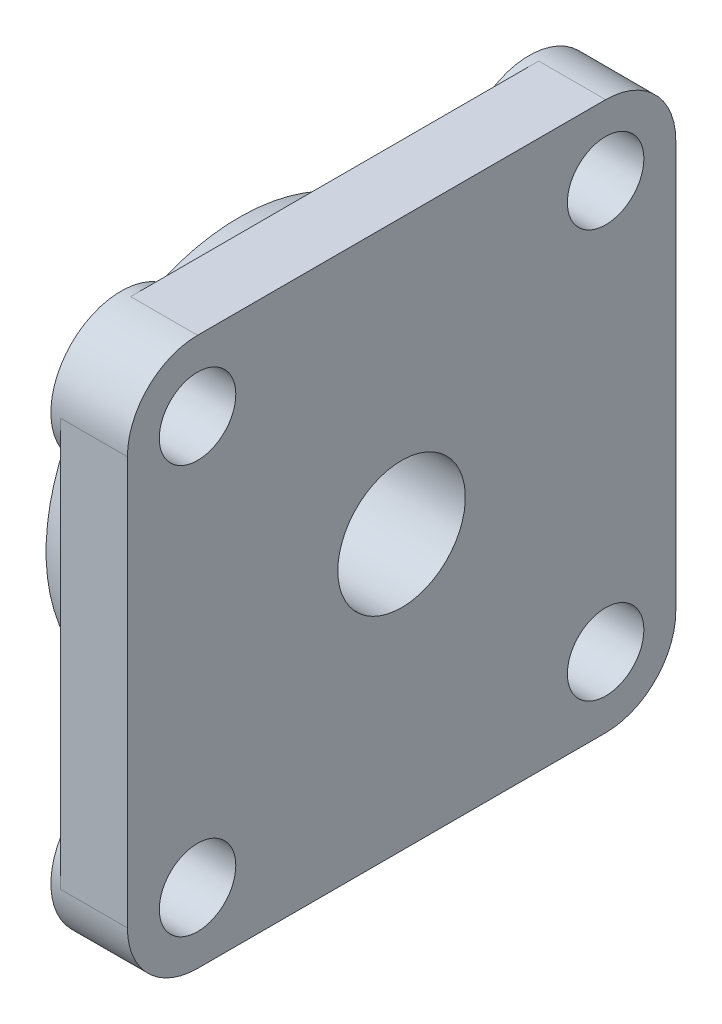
ISO-10303-21;
HEADER;
FILE_DESCRIPTION(('STEP AP214'),'2;1');
FILE_NAME('part.step','',(''),(''),'','','');
FILE_SCHEMA(('AUTOMOTIVE_DESIGN { 1 0 10303 214 1 1 1 1 }'));
ENDSEC;
DATA;
#1=APPLICATION_CONTEXT('core data for automotive mechanical design processes');
#2=APPLICATION_PROTOCOL_DEFINITION('international standard','automotive_design',2000,#1);
#3=PRODUCT_CONTEXT('',#1,'mechanical');
#4=PRODUCT('Part','Part','',(#3));
#5=PRODUCT_RELATED_PRODUCT_CATEGORY('part','',(#4));
#6=PRODUCT_DEFINITION_FORMATION('','',#4);
#7=PRODUCT_DEFINITION_CONTEXT('part definition',#1,'design');
#8=PRODUCT_DEFINITION('design','',#6,#7);
#9=PRODUCT_DEFINITION_SHAPE('','',#8);
#10=(LENGTH_UNIT() NAMED_UNIT(*) SI_UNIT(.MILLI.,.METRE.));
#11=(NAMED_UNIT(*) PLANE_ANGLE_UNIT() SI_UNIT($,.RADIAN.));
#12=(NAMED_UNIT(*) SI_UNIT($,.STERADIAN.) SOLID_ANGLE_UNIT());
#13=UNCERTAINTY_MEASURE_WITH_UNIT(LENGTH_MEASURE(1.E-05),#10,'distance_accuracy_value','');
#14=(GEOMETRIC_REPRESENTATION_CONTEXT(3) GLOBAL_UNCERTAINTY_ASSIGNED_CONTEXT((#13)) GLOBAL_UNIT_ASSIGNED_CONTEXT((#10,
#11,#12)) REPRESENTATION_CONTEXT('',''));
#15=CARTESIAN_POINT('',(0.,0.,0.));
#16=DIRECTION('',(0.,0.,1.));
#17=DIRECTION('',(1.,0.,0.));
#18=AXIS2_PLACEMENT_3D('',#15,#16,#17);
#19=CARTESIAN_POINT('',(-12.,-15.8419293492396,-27.7074869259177));
#20=CARTESIAN_POINT('',(-12.,-15.8419293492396,-35.1684321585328));
#21=CARTESIAN_POINT('',(-12.,-15.8419293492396,-35.2430416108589));
#22=CARTESIAN_POINT('',(-12.,-15.8419293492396,-35.6056914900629));
#23=B_SPLINE_CURVE_WITH_KNOTS('',1,(#19,#20,#21,#22),.UNSPECIFIED.,.F.,.F.,(2,1,1,2),(0.,1.,
1.01,1.05860642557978),.UNSPECIFIED.);
#24=DIRECTION('',(0.,1.,0.));
#25=VECTOR('',#24,1.);
#26=SURFACE_OF_LINEAR_EXTRUSION('',#23,#25);
#27=CARTESIAN_POINT('',(-12.,0.,0.));
#28=DIRECTION('',(1.,0.,0.));
#29=DIRECTION('',(0.,0.,-1.));
#30=AXIS2_PLACEMENT_3D('',#27,#28,#29);
#31=CIRCLE('',#30,30.254833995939);
#32=CARTESIAN_POINT('',(-12.,-12.1511377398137,-27.7074869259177));
#33=VERTEX_POINT('',#32);
#34=CARTESIAN_POINT('',(-12.,12.1511377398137,-27.7074869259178));
#35=VERTEX_POINT('',#34);
#36=EDGE_CURVE('E516',#33,#35,#31,.T.);
#37=ORIENTED_EDGE('',*,*,#36,.F.);
#38=DIRECTION('',(0.,0.707106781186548,0.707106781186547));
#39=VECTOR('',#38,1.);
#40=CARTESIAN_POINT('',(-12.,-18.1864815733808,-33.7428307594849));
#41=LINE('',#40,#39);
#42=CARTESIAN_POINT('',(-12.,-15.8419293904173,-31.3982785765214));
#43=VERTEX_POINT('',#42);
#44=EDGE_CURVE('E961',#43,#33,#41,.T.);
#45=ORIENTED_EDGE('',*,*,#44,.F.);
#46=CARTESIAN_POINT('',(-12.,0.,0.));
#47=DIRECTION('',(1.,0.,0.));
#48=DIRECTION('',(0.,0.,-1.));
#49=AXIS2_PLACEMENT_3D('',#46,#47,#48);
#50=CIRCLE('',#49,35.1684321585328);
#51=CARTESIAN_POINT('',(-12.,15.8419293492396,-31.3982785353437));
#52=VERTEX_POINT('',#51);
#53=EDGE_CURVE('E512',#52,#43,#50,.F.);
#54=ORIENTED_EDGE('',*,*,#53,.F.);
#55=DIRECTION('',(0.,0.707106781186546,-0.707106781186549));
#56=VECTOR('',#55,1.);
#57=CARTESIAN_POINT('',(-12.,18.1864815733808,-33.7428307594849));
#58=LINE('',#57,#56);
#59=EDGE_CURVE('E233',#35,#52,#58,.T.);
#60=ORIENTED_EDGE('',*,*,#59,.F.);
#61=EDGE_LOOP('',(#37,#45,#54,#60));
#62=FACE_BOUND('',#61,.T.);
#63=ADVANCED_FACE('F16',(#62),#26,.T.);
#64=CARTESIAN_POINT('',(-12.,-35.2131978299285,15.8419293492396));
#65=DIRECTION('',(1.,0.,0.));
#66=DIRECTION('',(0.,0.,-1.));
#67=AXIS2_PLACEMENT_3D('',#64,#65,#66);
#68=PLANE('',#67);
#69=DIRECTION('',(0.,0.707106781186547,-0.707106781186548));
#70=VECTOR('',#69,1.);
#71=CARTESIAN_POINT('',(-12.,-33.7428307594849,18.1864815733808));
#72=LINE('',#71,#70);
#73=CARTESIAN_POINT('',(-12.,-31.3982785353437,15.8419293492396));
#74=VERTEX_POINT('',#73);
#75=CARTESIAN_POINT('',(-12.,-27.7074869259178,12.1511377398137));
#76=VERTEX_POINT('',#75);
#77=EDGE_CURVE('E405',#74,#76,#72,.T.);
#78=ORIENTED_EDGE('',*,*,#77,.F.);
#79=CARTESIAN_POINT('',(-12.,0.,0.));
#80=DIRECTION('',(1.,0.,0.));
#81=DIRECTION('',(0.,0.,-1.));
#82=AXIS2_PLACEMENT_3D('',#79,#80,#81);
#83=CIRCLE('',#82,35.1684321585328);
#84=CARTESIAN_POINT('',(-12.,-31.3982785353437,-15.8419293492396));
#85=VERTEX_POINT('',#84);
#86=EDGE_CURVE('E509',#85,#74,#83,.F.);
#87=ORIENTED_EDGE('',*,*,#86,.F.);
#88=DIRECTION('',(0.,-0.707106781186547,-0.707106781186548));
#89=VECTOR('',#88,1.);
#90=CARTESIAN_POINT('',(-12.,-33.7428307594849,-18.1864815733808));
#91=LINE('',#90,#89);
#92=CARTESIAN_POINT('',(-12.,-27.7074869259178,-12.1511377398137));
#93=VERTEX_POINT('',#92);
#94=EDGE_CURVE('E311',#93,#85,#91,.T.);
#95=ORIENTED_EDGE('',*,*,#94,.F.);
#96=CARTESIAN_POINT('',(-12.,0.,0.));
#97=DIRECTION('',(1.,0.,0.));
#98=DIRECTION('',(0.,0.,-1.));
#99=AXIS2_PLACEMENT_3D('',#96,#97,#98);
#100=CIRCLE('',#99,30.254833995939);
#101=EDGE_CURVE('E209',#76,#93,#100,.T.);
#102=ORIENTED_EDGE('',*,*,#101,.F.);
#103=EDGE_LOOP('',(#78,#87,#95,#102));
#104=FACE_BOUND('',#103,.T.);
#105=ADVANCED_FACE('F526',(#104),#68,.T.);
#106=CARTESIAN_POINT('',(-12.,-15.8419293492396,35.6056914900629));
#107=CARTESIAN_POINT('',(-12.,-15.8419293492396,35.2430416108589));
#108=CARTESIAN_POINT('',(-12.,-15.8419293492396,35.1684321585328));
#109=CARTESIAN_POINT('',(-12.,-15.8419293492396,27.7074869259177));
#110=B_SPLINE_CURVE_WITH_KNOTS('',1,(#106,#107,#108,#109),.UNSPECIFIED.,.F.,.F.,(2,1,1,2),
(-0.0586064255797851,-0.01,0.,1.),.UNSPECIFIED.);
#111=DIRECTION('',(0.,1.,0.));
#112=VECTOR('',#111,1.);
#113=SURFACE_OF_LINEAR_EXTRUSION('',#110,#112);
#114=CARTESIAN_POINT('',(-12.,0.,0.));
#115=DIRECTION('',(1.,0.,0.));
#116=DIRECTION('',(0.,0.,-1.));
#117=AXIS2_PLACEMENT_3D('',#114,#115,#116);
#118=CIRCLE('',#117,30.254833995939);
#119=CARTESIAN_POINT('',(-12.,12.1511377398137,27.7074869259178));
#120=VERTEX_POINT('',#119);
#121=CARTESIAN_POINT('',(-12.,-12.1511377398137,27.7074869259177));
#122=VERTEX_POINT('',#121);
#123=EDGE_CURVE('E20',#120,#122,#118,.T.);
#124=ORIENTED_EDGE('',*,*,#123,.F.);
#125=DIRECTION('',(0.,-0.707106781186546,-0.707106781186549));
#126=VECTOR('',#125,1.);
#127=CARTESIAN_POINT('',(-12.,18.1864815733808,33.7428307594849));
#128=LINE('',#127,#126);
#129=CARTESIAN_POINT('',(-12.,15.8419295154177,31.3982787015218));
#130=VERTEX_POINT('',#129);
#131=EDGE_CURVE('E203',#130,#120,#128,.T.);
#132=ORIENTED_EDGE('',*,*,#131,.F.);
#133=CARTESIAN_POINT('',(-12.,0.,0.));
#134=DIRECTION('',(1.,0.,0.));
#135=DIRECTION('',(0.,0.,-1.));
#136=AXIS2_PLACEMENT_3D('',#133,#134,#135);
#137=CIRCLE('',#136,35.1684321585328);
#138=CARTESIAN_POINT('',(-12.,-15.8419293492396,31.3982785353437));
#139=VERTEX_POINT('',#138);
#140=EDGE_CURVE('E507',#139,#130,#137,.F.);
#141=ORIENTED_EDGE('',*,*,#140,.F.);
#142=DIRECTION('',(0.,-0.707106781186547,0.707106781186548));
#143=VECTOR('',#142,1.);
#144=CARTESIAN_POINT('',(-12.,-18.1864815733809,33.7428307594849));
#145=LINE('',#144,#143);
#146=EDGE_CURVE('E206',#122,#139,#145,.T.);
#147=ORIENTED_EDGE('',*,*,#146,.F.);
#148=EDGE_LOOP('',(#124,#132,#141,#147));
#149=FACE_BOUND('',#148,.T.);
#150=ADVANCED_FACE('F201',(#149),#113,.T.);
#151=CARTESIAN_POINT('',(-12.,27.6627212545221,15.8419293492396));
#152=DIRECTION('',(1.,0.,0.));
#153=DIRECTION('',(0.,0.,-1.));
#154=AXIS2_PLACEMENT_3D('',#151,#152,#153);
#155=PLANE('',#154);
#156=DIRECTION('',(0.,-0.707106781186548,0.707106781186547));
#157=VECTOR('',#156,1.);
#158=CARTESIAN_POINT('',(-12.,33.7428307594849,-18.1864815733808));
#159=LINE('',#158,#157);
#160=CARTESIAN_POINT('',(-12.,31.3982785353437,-15.8419293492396));
#161=VERTEX_POINT('',#160);
#162=CARTESIAN_POINT('',(-12.,27.7074869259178,-12.1511377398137));
#163=VERTEX_POINT('',#162);
#164=EDGE_CURVE('E237',#161,#163,#159,.T.);
#165=ORIENTED_EDGE('',*,*,#164,.F.);
#166=CARTESIAN_POINT('',(-12.,0.,0.));
#167=DIRECTION('',(1.,0.,0.));
#168=DIRECTION('',(0.,0.,-1.));
#169=AXIS2_PLACEMENT_3D('',#166,#167,#168);
#170=CIRCLE('',#169,35.1684321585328);
#171=CARTESIAN_POINT('',(-12.,31.3982785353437,15.8419293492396));
#172=VERTEX_POINT('',#171);
#173=EDGE_CURVE('E432',#172,#161,#170,.F.);
#174=ORIENTED_EDGE('',*,*,#173,.F.);
#175=DIRECTION('',(0.,0.707106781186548,0.707106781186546));
#176=VECTOR('',#175,1.);
#177=CARTESIAN_POINT('',(-12.,33.7428307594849,18.1864815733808));
#178=LINE('',#177,#176);
#179=CARTESIAN_POINT('',(-12.,27.7074869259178,12.1511377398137));
#180=VERTEX_POINT('',#179);
#181=EDGE_CURVE('E319',#180,#172,#178,.T.);
#182=ORIENTED_EDGE('',*,*,#181,.F.);
#183=CARTESIAN_POINT('',(-12.,0.,0.));
#184=DIRECTION('',(1.,0.,0.));
#185=DIRECTION('',(0.,0.,-1.));
#186=AXIS2_PLACEMENT_3D('',#183,#184,#185);
#187=CIRCLE('',#186,30.2548339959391);
#188=EDGE_CURVE('E401',#163,#180,#187,.T.);
#189=ORIENTED_EDGE('',*,*,#188,.F.);
#190=EDGE_LOOP('',(#165,#174,#182,#189));
#191=FACE_BOUND('',#190,.T.);
#192=ADVANCED_FACE('F932',(#191),#155,.T.);
#193=CARTESIAN_POINT('',(-10.5,0.,0.));
#194=DIRECTION('',(1.,0.,0.));
#195=DIRECTION('',(0.,0.,-1.));
#196=AXIS2_PLACEMENT_3D('',#193,#194,#195);
#197=CYLINDRICAL_SURFACE('',#196,30.254833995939);
#198=ORIENTED_EDGE('',*,*,#123,.T.);
#199=DIRECTION('',(1.,0.,0.));
#200=VECTOR('',#199,1.);
#201=CARTESIAN_POINT('',(-12.,-12.1511377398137,27.7074869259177));
#202=LINE('',#201,#200);
#203=CARTESIAN_POINT('',(-10.5,-12.1511377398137,27.7074869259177));
#204=VERTEX_POINT('',#203);
#205=EDGE_CURVE('E411',#204,#122,#202,.F.);
#206=ORIENTED_EDGE('',*,*,#205,.F.);
#207=CARTESIAN_POINT('',(-10.5,0.,0.));
#208=DIRECTION('',(1.,0.,0.));
#209=DIRECTION('',(0.,0.,-1.));
#210=AXIS2_PLACEMENT_3D('',#207,#208,#209);
#211=CIRCLE('',#210,30.254833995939);
#212=CARTESIAN_POINT('',(-10.5,12.1511377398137,27.7074869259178));
#213=VERTEX_POINT('',#212);
#214=EDGE_CURVE('E214',#213,#204,#211,.T.);
#215=ORIENTED_EDGE('',*,*,#214,.F.);
#216=DIRECTION('',(1.,0.,0.));
#217=VECTOR('',#216,1.);
#218=CARTESIAN_POINT('',(-12.,12.1511377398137,27.7074869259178));
#219=LINE('',#218,#217);
#220=EDGE_CURVE('E211',#120,#213,#219,.T.);
#221=ORIENTED_EDGE('',*,*,#220,.F.);
#222=EDGE_LOOP('',(#198,#206,#215,#221));
#223=FACE_BOUND('',#222,.T.);
#224=ADVANCED_FACE('F212',(#223),#197,.T.);
#225=CARTESIAN_POINT('',(-10.5,0.,0.));
#226=DIRECTION('',(1.,0.,0.));
#227=DIRECTION('',(0.,0.,-1.));
#228=AXIS2_PLACEMENT_3D('',#225,#226,#227);
#229=CYLINDRICAL_SURFACE('',#228,30.254833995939);
#230=ORIENTED_EDGE('',*,*,#101,.T.);
#231=DIRECTION('',(1.,0.,0.));
#232=VECTOR('',#231,1.);
#233=CARTESIAN_POINT('',(-12.,-27.7074869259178,-12.1511377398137));
#234=LINE('',#233,#232);
#235=CARTESIAN_POINT('',(-10.5,-27.7074869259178,-12.1511377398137));
#236=VERTEX_POINT('',#235);
#237=EDGE_CURVE('E393',#236,#93,#234,.F.);
#238=ORIENTED_EDGE('',*,*,#237,.F.);
#239=CARTESIAN_POINT('',(-10.5,0.,0.));
#240=DIRECTION('',(1.,0.,0.));
#241=DIRECTION('',(0.,0.,-1.));
#242=AXIS2_PLACEMENT_3D('',#239,#240,#241);
#243=CIRCLE('',#242,30.254833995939);
#244=CARTESIAN_POINT('',(-10.5,-27.7074869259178,12.1511377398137));
#245=VERTEX_POINT('',#244);
#246=EDGE_CURVE('E392',#245,#236,#243,.T.);
#247=ORIENTED_EDGE('',*,*,#246,.F.);
#248=DIRECTION('',(1.,0.,0.));
#249=VECTOR('',#248,1.);
#250=CARTESIAN_POINT('',(-12.,-27.7074869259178,12.1511377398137));
#251=LINE('',#250,#249);
#252=EDGE_CURVE('E402',#76,#245,#251,.T.);
#253=ORIENTED_EDGE('',*,*,#252,.F.);
#254=EDGE_LOOP('',(#230,#238,#247,#253));
#255=FACE_BOUND('',#254,.T.);
#256=ADVANCED_FACE('F520',(#255),#229,.T.);
#257=CARTESIAN_POINT('',(-10.5,0.,0.));
#258=DIRECTION('',(1.,0.,0.));
#259=DIRECTION('',(0.,0.,-1.));
#260=AXIS2_PLACEMENT_3D('',#257,#258,#259);
#261=CYLINDRICAL_SURFACE('',#260,30.254833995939);
#262=ORIENTED_EDGE('',*,*,#36,.T.);
#263=DIRECTION('',(1.,0.,0.));
#264=VECTOR('',#263,1.);
#265=CARTESIAN_POINT('',(-12.,12.1511377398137,-27.7074869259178));
#266=LINE('',#265,#264);
#267=CARTESIAN_POINT('',(-10.5,12.1511377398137,-27.7074869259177));
#268=VERTEX_POINT('',#267);
#269=EDGE_CURVE('E236',#268,#35,#266,.F.);
#270=ORIENTED_EDGE('',*,*,#269,.F.);
#271=CARTESIAN_POINT('',(-10.5,0.,0.));
#272=DIRECTION('',(1.,0.,0.));
#273=DIRECTION('',(0.,0.,-1.));
#274=AXIS2_PLACEMENT_3D('',#271,#272,#273);
#275=CIRCLE('',#274,30.254833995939);
#276=CARTESIAN_POINT('',(-10.5,-12.1511377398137,-27.7074869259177));
#277=VERTEX_POINT('',#276);
#278=EDGE_CURVE('E326',#277,#268,#275,.T.);
#279=ORIENTED_EDGE('',*,*,#278,.F.);
#280=DIRECTION('',(1.,0.,0.));
#281=VECTOR('',#280,1.);
#282=CARTESIAN_POINT('',(-12.,-12.1511377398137,-27.7074869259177));
#283=LINE('',#282,#281);
#284=EDGE_CURVE('E246',#33,#277,#283,.T.);
#285=ORIENTED_EDGE('',*,*,#284,.F.);
#286=EDGE_LOOP('',(#262,#270,#279,#285));
#287=FACE_BOUND('',#286,.T.);
#288=ADVANCED_FACE('F911',(#287),#261,.T.);
#289=CARTESIAN_POINT('',(-10.5,0.,0.));
#290=DIRECTION('',(1.,0.,0.));
#291=DIRECTION('',(0.,0.,-1.));
#292=AXIS2_PLACEMENT_3D('',#289,#290,#291);
#293=CYLINDRICAL_SURFACE('',#292,30.2548339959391);
#294=ORIENTED_EDGE('',*,*,#188,.T.);
#295=DIRECTION('',(1.,0.,0.));
#296=VECTOR('',#295,1.);
#297=CARTESIAN_POINT('',(-12.,27.7074869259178,12.1511377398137));
#298=LINE('',#297,#296);
#299=CARTESIAN_POINT('',(-10.5,27.7074869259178,12.1511377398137));
#300=VERTEX_POINT('',#299);
#301=EDGE_CURVE('E218',#300,#180,#298,.F.);
#302=ORIENTED_EDGE('',*,*,#301,.F.);
#303=CARTESIAN_POINT('',(-10.5,0.,0.));
#304=DIRECTION('',(1.,0.,0.));
#305=DIRECTION('',(0.,0.,-1.));
#306=AXIS2_PLACEMENT_3D('',#303,#304,#305);
#307=CIRCLE('',#306,30.2548339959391);
#308=CARTESIAN_POINT('',(-10.5,27.7074869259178,-12.1511377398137));
#309=VERTEX_POINT('',#308);
#310=EDGE_CURVE('E310',#309,#300,#307,.T.);
#311=ORIENTED_EDGE('',*,*,#310,.F.);
#312=DIRECTION('',(1.,0.,0.));
#313=VECTOR('',#312,1.);
#314=CARTESIAN_POINT('',(-12.,27.7074869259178,-12.1511377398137));
#315=LINE('',#314,#313);
#316=EDGE_CURVE('E240',#163,#309,#315,.T.);
#317=ORIENTED_EDGE('',*,*,#316,.F.);
#318=EDGE_LOOP('',(#294,#302,#311,#317));
#319=FACE_BOUND('',#318,.T.);
#320=ADVANCED_FACE('F904',(#319),#293,.T.);
#321=CARTESIAN_POINT('',(-12.,-27.7074869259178,-12.1511377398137));
#322=DIRECTION('',(0.,-0.707106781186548,0.707106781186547));
#323=DIRECTION('',(0.,-0.707106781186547,-0.707106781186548));
#324=AXIS2_PLACEMENT_3D('',#321,#322,#323);
#325=PLANE('',#324);
#326=CARTESIAN_POINT('',(-12.,-39.778174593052,-24.221825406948));
#327=CARTESIAN_POINT('',(-12.,-39.4290122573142,-23.8726630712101));
#328=CARTESIAN_POINT('',(-12.,-39.0798499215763,-23.5235007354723));
#329=CARTESIAN_POINT('',(-12.,-38.3815252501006,-22.8251760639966));
#330=CARTESIAN_POINT('',(-12.,-38.0323629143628,-22.4760137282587));
#331=CARTESIAN_POINT('',(-12.,-37.3340382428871,-21.777689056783));
#332=CARTESIAN_POINT('',(-12.,-36.9848759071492,-21.4285267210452));
#333=CARTESIAN_POINT('',(-12.,-36.2865512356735,-20.7302020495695));
#334=CARTESIAN_POINT('',(-12.,-35.9373888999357,-20.3810397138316));
#335=CARTESIAN_POINT('',(-12.,-35.23906422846,-19.6827150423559));
#336=CARTESIAN_POINT('',(-12.,-34.8899018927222,-19.3335527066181));
#337=CARTESIAN_POINT('',(-12.,-34.1915772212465,-18.6352280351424));
#338=CARTESIAN_POINT('',(-12.,-33.8424148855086,-18.2860656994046));
#339=CARTESIAN_POINT('',(-12.,-33.1440902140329,-17.5877410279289));
#340=CARTESIAN_POINT('',(-12.,-32.7949278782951,-17.238578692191));
#341=CARTESIAN_POINT('',(-12.,-32.0966032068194,-16.5402540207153));
#342=CARTESIAN_POINT('',(-12.,-31.7474408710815,-16.1910916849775));
#343=CARTESIAN_POINT('',(-12.,-31.3982785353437,-15.8419293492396));
#344=B_SPLINE_CURVE_WITH_KNOTS('',3,(#326,#327,#328,#329,#330,#331,#332,#333,#334,#335,#336,
#337,#338,#339,#340,#341,#342,#343),.UNSPECIFIED.,.F.,.F.,(4,2,2,2,2,2,2,2,4),(0.,
1.481370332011,2.962740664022,4.44411099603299,5.92548132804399,7.406851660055,8.88822199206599,
10.369592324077,11.850962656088),.UNSPECIFIED.);
#345=CARTESIAN_POINT('',(-12.,-39.778174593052,-24.221825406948));
#346=VERTEX_POINT('',#345);
#347=EDGE_CURVE('E247',#346,#85,#344,.T.);
#348=ORIENTED_EDGE('',*,*,#347,.F.);
#349=DIRECTION('',(-1.,0.,0.));
#350=VECTOR('',#349,1.);
#351=CARTESIAN_POINT('',(-11.25,-39.778174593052,-24.221825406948));
#352=LINE('',#351,#350);
#353=CARTESIAN_POINT('',(-10.5,-39.778174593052,-24.221825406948));
#354=VERTEX_POINT('',#353);
#355=EDGE_CURVE('E243',#354,#346,#352,.T.);
#356=ORIENTED_EDGE('',*,*,#355,.F.);
#357=CARTESIAN_POINT('',(-10.5,-27.7074869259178,-12.1511377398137));
#358=CARTESIAN_POINT('',(-10.5,-28.2104322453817,-12.6540830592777));
#359=CARTESIAN_POINT('',(-10.5,-28.7133775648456,-13.1570283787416));
#360=CARTESIAN_POINT('',(-10.5,-29.7192682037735,-14.1629190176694));
#361=CARTESIAN_POINT('',(-10.5,-30.2222135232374,-14.6658643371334));
#362=CARTESIAN_POINT('',(-10.5,-31.2281041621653,-15.6717549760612));
#363=CARTESIAN_POINT('',(-10.5,-31.7310494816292,-16.1747002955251));
#364=CARTESIAN_POINT('',(-10.5,-32.736940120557,-17.180590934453));
#365=CARTESIAN_POINT('',(-10.5,-33.239885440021,-17.6835362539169));
#366=CARTESIAN_POINT('',(-10.5,-34.2457760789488,-18.6894268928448));
#367=CARTESIAN_POINT('',(-10.5,-34.7487213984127,-19.1923722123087));
#368=CARTESIAN_POINT('',(-10.5,-35.7546120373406,-20.1982628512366));
#369=CARTESIAN_POINT('',(-10.5,-36.2575573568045,-20.7012081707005));
#370=CARTESIAN_POINT('',(-10.5,-37.2634479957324,-21.7070988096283));
#371=CARTESIAN_POINT('',(-10.5,-37.7663933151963,-22.2100441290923));
#372=CARTESIAN_POINT('',(-10.5,-38.7722839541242,-23.2159347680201));
#373=CARTESIAN_POINT('',(-10.5,-39.2752292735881,-23.7188800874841));
#374=CARTESIAN_POINT('',(-10.5,-39.778174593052,-24.221825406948));
#375=B_SPLINE_CURVE_WITH_KNOTS('',3,(#357,#358,#359,#360,#361,#362,#363,#364,#365,#366,#367,
#368,#369,#370,#371,#372,#373,#374),.UNSPECIFIED.,.F.,.F.,(4,2,2,2,2,2,2,2,4),(0.,
2.13381627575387,4.26763255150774,6.4014488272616,8.53526510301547,10.6690813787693,
12.8028976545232,14.9367139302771,17.0705302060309),.UNSPECIFIED.);
#376=EDGE_CURVE('E388',#236,#354,#375,.T.);
#377=ORIENTED_EDGE('',*,*,#376,.F.);
#378=ORIENTED_EDGE('',*,*,#237,.T.);
#379=ORIENTED_EDGE('',*,*,#94,.T.);
#380=EDGE_LOOP('',(#348,#356,#377,#378,#379));
#381=FACE_BOUND('',#380,.T.);
#382=ADVANCED_FACE('F530',(#381),#325,.T.);
#383=CARTESIAN_POINT('',(-12.,-24.221825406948,-39.778174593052));
#384=DIRECTION('',(0.,0.707106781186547,-0.707106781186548));
#385=DIRECTION('',(0.,0.707106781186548,0.707106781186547));
#386=AXIS2_PLACEMENT_3D('',#383,#384,#385);
#387=PLANE('',#386);
#388=ORIENTED_EDGE('',*,*,#44,.T.);
#389=ORIENTED_EDGE('',*,*,#284,.T.);
#390=CARTESIAN_POINT('',(-10.5,-24.221825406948,-39.778174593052));
#391=CARTESIAN_POINT('',(-10.5,-23.718880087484,-39.2752292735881));
#392=CARTESIAN_POINT('',(-10.5,-23.2159347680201,-38.7722839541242));
#393=CARTESIAN_POINT('',(-10.5,-22.2100441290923,-37.7663933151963));
#394=CARTESIAN_POINT('',(-10.5,-21.7070988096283,-37.2634479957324));
#395=CARTESIAN_POINT('',(-10.5,-20.7012081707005,-36.2575573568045));
#396=CARTESIAN_POINT('',(-10.5,-20.1982628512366,-35.7546120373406));
#397=CARTESIAN_POINT('',(-10.5,-19.1923722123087,-34.7487213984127));
#398=CARTESIAN_POINT('',(-10.5,-18.6894268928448,-34.2457760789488));
#399=CARTESIAN_POINT('',(-10.5,-17.6835362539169,-33.239885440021));
#400=CARTESIAN_POINT('',(-10.5,-17.180590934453,-32.736940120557));
#401=CARTESIAN_POINT('',(-10.5,-16.1747002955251,-31.7310494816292));
#402=CARTESIAN_POINT('',(-10.5,-15.6717549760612,-31.2281041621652));
#403=CARTESIAN_POINT('',(-10.5,-14.6658643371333,-30.2222135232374));
#404=CARTESIAN_POINT('',(-10.5,-14.1629190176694,-29.7192682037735));
#405=CARTESIAN_POINT('',(-10.5,-13.1570283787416,-28.7133775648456));
#406=CARTESIAN_POINT('',(-10.5,-12.6540830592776,-28.2104322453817));
#407=CARTESIAN_POINT('',(-10.5,-12.1511377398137,-27.7074869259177));
#408=B_SPLINE_CURVE_WITH_KNOTS('',3,(#390,#391,#392,#393,#394,#395,#396,#397,#398,#399,#400,
#401,#402,#403,#404,#405,#406,#407),.UNSPECIFIED.,.F.,.F.,(4,2,2,2,2,2,2,2,4),(0.,
2.13381627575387,4.26763255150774,6.40144882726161,8.53526510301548,10.6690813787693,
12.8028976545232,14.9367139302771,17.070530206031),.UNSPECIFIED.);
#409=CARTESIAN_POINT('',(-10.5,-24.221825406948,-39.778174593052));
#410=VERTEX_POINT('',#409);
#411=EDGE_CURVE('E350',#410,#277,#408,.T.);
#412=ORIENTED_EDGE('',*,*,#411,.F.);
#413=DIRECTION('',(1.,0.,0.));
#414=VECTOR('',#413,1.);
#415=CARTESIAN_POINT('',(-12.,-24.221825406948,-39.778174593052));
#416=LINE('',#415,#414);
#417=CARTESIAN_POINT('',(-12.,-24.221825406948,-39.778174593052));
#418=VERTEX_POINT('',#417);
#419=EDGE_CURVE('E254',#410,#418,#416,.F.);
#420=ORIENTED_EDGE('',*,*,#419,.T.);
#421=CARTESIAN_POINT('',(-12.,-15.8419293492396,-31.3982785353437));
#422=CARTESIAN_POINT('',(-12.,-16.1910916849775,-31.7474408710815));
#423=CARTESIAN_POINT('',(-12.,-16.5402540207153,-32.0966032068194));
#424=CARTESIAN_POINT('',(-12.,-17.238578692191,-32.7949278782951));
#425=CARTESIAN_POINT('',(-12.,-17.5877410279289,-33.1440902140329));
#426=CARTESIAN_POINT('',(-12.,-18.2860656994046,-33.8424148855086));
#427=CARTESIAN_POINT('',(-12.,-18.6352280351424,-34.1915772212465));
#428=CARTESIAN_POINT('',(-12.,-19.3335527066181,-34.8899018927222));
#429=CARTESIAN_POINT('',(-12.,-19.682715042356,-35.23906422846));
#430=CARTESIAN_POINT('',(-12.,-20.3810397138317,-35.9373888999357));
#431=CARTESIAN_POINT('',(-12.,-20.7302020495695,-36.2865512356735));
#432=CARTESIAN_POINT('',(-12.,-21.4285267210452,-36.9848759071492));
#433=CARTESIAN_POINT('',(-12.,-21.777689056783,-37.3340382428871));
#434=CARTESIAN_POINT('',(-12.,-22.4760137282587,-38.0323629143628));
#435=CARTESIAN_POINT('',(-12.,-22.8251760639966,-38.3815252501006));
#436=CARTESIAN_POINT('',(-12.,-23.5235007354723,-39.0798499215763));
#437=CARTESIAN_POINT('',(-12.,-23.8726630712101,-39.4290122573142));
#438=CARTESIAN_POINT('',(-12.,-24.221825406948,-39.778174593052));
#439=B_SPLINE_CURVE_WITH_KNOTS('',3,(#421,#422,#423,#424,#425,#426,#427,#428,#429,#430,#431,
#432,#433,#434,#435,#436,#437,#438),.UNSPECIFIED.,.F.,.F.,(4,2,2,2,2,2,2,2,4),(0.,
1.481370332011,2.962740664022,4.444110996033,5.925481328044,7.406851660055,8.88822199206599,
10.369592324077,11.850962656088),.UNSPECIFIED.);
#440=EDGE_CURVE('E355',#43,#418,#439,.T.);
#441=ORIENTED_EDGE('',*,*,#440,.F.);
#442=EDGE_LOOP('',(#388,#389,#412,#420,#441));
#443=FACE_BOUND('',#442,.T.);
#444=ADVANCED_FACE('F889',(#443),#387,.T.);
#445=CARTESIAN_POINT('',(-12.,39.778174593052,-24.221825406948));
#446=DIRECTION('',(0.,0.707106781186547,0.707106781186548));
#447=DIRECTION('',(0.,-0.707106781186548,0.707106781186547));
#448=AXIS2_PLACEMENT_3D('',#445,#446,#447);
#449=PLANE('',#448);
#450=ORIENTED_EDGE('',*,*,#164,.T.);
#451=ORIENTED_EDGE('',*,*,#316,.T.);
#452=CARTESIAN_POINT('',(-10.5,39.778174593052,-24.221825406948));
#453=CARTESIAN_POINT('',(-10.5,39.2752292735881,-23.718880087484));
#454=CARTESIAN_POINT('',(-10.5,38.7722839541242,-23.2159347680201));
#455=CARTESIAN_POINT('',(-10.5,37.7663933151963,-22.2100441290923));
#456=CARTESIAN_POINT('',(-10.5,37.2634479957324,-21.7070988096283));
#457=CARTESIAN_POINT('',(-10.5,36.2575573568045,-20.7012081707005));
#458=CARTESIAN_POINT('',(-10.5,35.7546120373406,-20.1982628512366));
#459=CARTESIAN_POINT('',(-10.5,34.7487213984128,-19.1923722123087));
#460=CARTESIAN_POINT('',(-10.5,34.2457760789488,-18.6894268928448));
#461=CARTESIAN_POINT('',(-10.5,33.239885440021,-17.6835362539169));
#462=CARTESIAN_POINT('',(-10.5,32.7369401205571,-17.180590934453));
#463=CARTESIAN_POINT('',(-10.5,31.7310494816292,-16.1747002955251));
#464=CARTESIAN_POINT('',(-10.5,31.2281041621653,-15.6717549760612));
#465=CARTESIAN_POINT('',(-10.5,30.2222135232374,-14.6658643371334));
#466=CARTESIAN_POINT('',(-10.5,29.7192682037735,-14.1629190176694));
#467=CARTESIAN_POINT('',(-10.5,28.7133775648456,-13.1570283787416));
#468=CARTESIAN_POINT('',(-10.5,28.2104322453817,-12.6540830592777));
#469=CARTESIAN_POINT('',(-10.5,27.7074869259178,-12.1511377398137));
#470=B_SPLINE_CURVE_WITH_KNOTS('',3,(#452,#453,#454,#455,#456,#457,#458,#459,#460,#461,#462,
#463,#464,#465,#466,#467,#468,#469),.UNSPECIFIED.,.F.,.F.,(4,2,2,2,2,2,2,2,4),(0.,
2.13381627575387,4.26763255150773,6.40144882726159,8.53526510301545,10.6690813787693,
12.8028976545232,14.936713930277,17.0705302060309),.UNSPECIFIED.);
#471=CARTESIAN_POINT('',(-10.5,39.778174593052,-24.221825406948));
#472=VERTEX_POINT('',#471);
#473=EDGE_CURVE('E301',#472,#309,#470,.T.);
#474=ORIENTED_EDGE('',*,*,#473,.F.);
#475=DIRECTION('',(1.,0.,0.));
#476=VECTOR('',#475,1.);
#477=CARTESIAN_POINT('',(-12.,39.778174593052,-24.221825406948));
#478=LINE('',#477,#476);
#479=CARTESIAN_POINT('',(-12.,39.778174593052,-24.221825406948));
#480=VERTEX_POINT('',#479);
#481=EDGE_CURVE('E241',#472,#480,#478,.F.);
#482=ORIENTED_EDGE('',*,*,#481,.T.);
#483=CARTESIAN_POINT('',(-12.,31.3982785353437,-15.8419293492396));
#484=CARTESIAN_POINT('',(-12.,31.7474408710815,-16.1910916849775));
#485=CARTESIAN_POINT('',(-12.,32.0966032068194,-16.5402540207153));
#486=CARTESIAN_POINT('',(-12.,32.7949278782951,-17.238578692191));
#487=CARTESIAN_POINT('',(-12.,33.1440902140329,-17.5877410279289));
#488=CARTESIAN_POINT('',(-12.,33.8424148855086,-18.2860656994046));
#489=CARTESIAN_POINT('',(-12.,34.1915772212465,-18.6352280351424));
#490=CARTESIAN_POINT('',(-12.,34.8899018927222,-19.3335527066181));
#491=CARTESIAN_POINT('',(-12.,35.23906422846,-19.6827150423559));
#492=CARTESIAN_POINT('',(-12.,35.9373888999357,-20.3810397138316));
#493=CARTESIAN_POINT('',(-12.,36.2865512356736,-20.7302020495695));
#494=CARTESIAN_POINT('',(-12.,36.9848759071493,-21.4285267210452));
#495=CARTESIAN_POINT('',(-12.,37.3340382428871,-21.777689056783));
#496=CARTESIAN_POINT('',(-12.,38.0323629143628,-22.4760137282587));
#497=CARTESIAN_POINT('',(-12.,38.3815252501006,-22.8251760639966));
#498=CARTESIAN_POINT('',(-12.,39.0798499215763,-23.5235007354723));
#499=CARTESIAN_POINT('',(-12.,39.4290122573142,-23.8726630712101));
#500=CARTESIAN_POINT('',(-12.,39.778174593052,-24.221825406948));
#501=B_SPLINE_CURVE_WITH_KNOTS('',3,(#483,#484,#485,#486,#487,#488,#489,#490,#491,#492,#493,
#494,#495,#496,#497,#498,#499,#500),.UNSPECIFIED.,.F.,.F.,(4,2,2,2,2,2,2,2,4),(0.,
1.481370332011,2.96274066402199,4.44411099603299,5.92548132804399,7.40685166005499,
8.88822199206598,10.369592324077,11.850962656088),.UNSPECIFIED.);
#502=EDGE_CURVE('E364',#161,#480,#501,.T.);
#503=ORIENTED_EDGE('',*,*,#502,.F.);
#504=EDGE_LOOP('',(#450,#451,#474,#482,#503));
#505=FACE_BOUND('',#504,.T.);
#506=ADVANCED_FACE('F881',(#505),#449,.T.);
#507=CARTESIAN_POINT('',(-12.,12.1511377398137,-27.7074869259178));
#508=DIRECTION('',(0.,-0.707106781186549,-0.707106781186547));
#509=DIRECTION('',(0.,0.707106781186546,-0.707106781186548));
#510=AXIS2_PLACEMENT_3D('',#507,#508,#509);
#511=PLANE('',#510);
#512=CARTESIAN_POINT('',(-12.,24.2218254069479,-39.778174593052));
#513=CARTESIAN_POINT('',(-12.,23.8726630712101,-39.4290122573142));
#514=CARTESIAN_POINT('',(-12.,23.5235007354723,-39.0798499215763));
#515=CARTESIAN_POINT('',(-12.,22.8251760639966,-38.3815252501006));
#516=CARTESIAN_POINT('',(-12.,22.4760137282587,-38.0323629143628));
#517=CARTESIAN_POINT('',(-12.,21.777689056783,-37.3340382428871));
#518=CARTESIAN_POINT('',(-12.,21.4285267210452,-36.9848759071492));
#519=CARTESIAN_POINT('',(-12.,20.7302020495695,-36.2865512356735));
#520=CARTESIAN_POINT('',(-12.,20.3810397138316,-35.9373888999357));
#521=CARTESIAN_POINT('',(-12.,19.6827150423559,-35.23906422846));
#522=CARTESIAN_POINT('',(-12.,19.3335527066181,-34.8899018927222));
#523=CARTESIAN_POINT('',(-12.,18.6352280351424,-34.1915772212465));
#524=CARTESIAN_POINT('',(-12.,18.2860656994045,-33.8424148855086));
#525=CARTESIAN_POINT('',(-12.,17.5877410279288,-33.1440902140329));
#526=CARTESIAN_POINT('',(-12.,17.238578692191,-32.7949278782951));
#527=CARTESIAN_POINT('',(-12.,16.5402540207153,-32.0966032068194));
#528=CARTESIAN_POINT('',(-12.,16.1910916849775,-31.7474408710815));
#529=CARTESIAN_POINT('',(-12.,15.8419293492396,-31.3982785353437));
#530=B_SPLINE_CURVE_WITH_KNOTS('',3,(#512,#513,#514,#515,#516,#517,#518,#519,#520,#521,#522,
#523,#524,#525,#526,#527,#528,#529),.UNSPECIFIED.,.F.,.F.,(4,2,2,2,2,2,2,2,4),(0.,
1.481370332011,2.96274066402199,4.44411099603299,5.92548132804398,7.40685166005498,
8.88822199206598,10.369592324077,11.850962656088),.UNSPECIFIED.);
#531=CARTESIAN_POINT('',(-12.,24.2218254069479,-39.778174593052));
#532=VERTEX_POINT('',#531);
#533=EDGE_CURVE('E277',#532,#52,#530,.T.);
#534=ORIENTED_EDGE('',*,*,#533,.F.);
#535=DIRECTION('',(1.,0.,0.));
#536=VECTOR('',#535,1.);
#537=CARTESIAN_POINT('',(-12.,24.2218254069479,-39.778174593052));
#538=LINE('',#537,#536);
#539=CARTESIAN_POINT('',(-10.5,24.221825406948,-39.778174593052));
#540=VERTEX_POINT('',#539);
#541=EDGE_CURVE('E226',#532,#540,#538,.T.);
#542=ORIENTED_EDGE('',*,*,#541,.T.);
#543=CARTESIAN_POINT('',(-10.5,12.1511377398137,-27.7074869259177));
#544=CARTESIAN_POINT('',(-10.5,12.6540830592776,-28.2104322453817));
#545=CARTESIAN_POINT('',(-10.5,13.1570283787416,-28.7133775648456));
#546=CARTESIAN_POINT('',(-10.5,14.1629190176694,-29.7192682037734));
#547=CARTESIAN_POINT('',(-10.5,14.6658643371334,-30.2222135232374));
#548=CARTESIAN_POINT('',(-10.5,15.6717549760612,-31.2281041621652));
#549=CARTESIAN_POINT('',(-10.5,16.1747002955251,-31.7310494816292));
#550=CARTESIAN_POINT('',(-10.5,17.180590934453,-32.736940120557));
#551=CARTESIAN_POINT('',(-10.5,17.6835362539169,-33.239885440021));
#552=CARTESIAN_POINT('',(-10.5,18.6894268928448,-34.2457760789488));
#553=CARTESIAN_POINT('',(-10.5,19.1923722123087,-34.7487213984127));
#554=CARTESIAN_POINT('',(-10.5,20.1982628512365,-35.7546120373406));
#555=CARTESIAN_POINT('',(-10.5,20.7012081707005,-36.2575573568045));
#556=CARTESIAN_POINT('',(-10.5,21.7070988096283,-37.2634479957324));
#557=CARTESIAN_POINT('',(-10.5,22.2100441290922,-37.7663933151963));
#558=CARTESIAN_POINT('',(-10.5,23.2159347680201,-38.7722839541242));
#559=CARTESIAN_POINT('',(-10.5,23.718880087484,-39.2752292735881));
#560=CARTESIAN_POINT('',(-10.5,24.2218254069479,-39.778174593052));
#561=B_SPLINE_CURVE_WITH_KNOTS('',3,(#543,#544,#545,#546,#547,#548,#549,#550,#551,#552,#553,
#554,#555,#556,#557,#558,#559,#560),.UNSPECIFIED.,.F.,.F.,(4,2,2,2,2,2,2,2,4),(0.,
2.13381627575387,4.26763255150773,6.40144882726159,8.53526510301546,10.6690813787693,
12.8028976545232,14.9367139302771,17.0705302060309),.UNSPECIFIED.);
#562=EDGE_CURVE('E321',#268,#540,#561,.T.);
#563=ORIENTED_EDGE('',*,*,#562,.F.);
#564=ORIENTED_EDGE('',*,*,#269,.T.);
#565=ORIENTED_EDGE('',*,*,#59,.T.);
#566=EDGE_LOOP('',(#534,#542,#563,#564,#565));
#567=FACE_BOUND('',#566,.T.);
#568=ADVANCED_FACE('F874',(#567),#511,.T.);
#569=CARTESIAN_POINT('',(-12.,24.2218254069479,39.778174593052));
#570=DIRECTION('',(0.,-0.707106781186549,0.707106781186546));
#571=DIRECTION('',(0.,-0.707106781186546,-0.707106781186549));
#572=AXIS2_PLACEMENT_3D('',#569,#570,#571);
#573=PLANE('',#572);
#574=ORIENTED_EDGE('',*,*,#131,.T.);
#575=ORIENTED_EDGE('',*,*,#220,.T.);
#576=CARTESIAN_POINT('',(-10.5,24.2218254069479,39.778174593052));
#577=CARTESIAN_POINT('',(-10.5,23.718880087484,39.2752292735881));
#578=CARTESIAN_POINT('',(-10.5,23.2159347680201,38.7722839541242));
#579=CARTESIAN_POINT('',(-10.5,22.2100441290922,37.7663933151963));
#580=CARTESIAN_POINT('',(-10.5,21.7070988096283,37.2634479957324));
#581=CARTESIAN_POINT('',(-10.5,20.7012081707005,36.2575573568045));
#582=CARTESIAN_POINT('',(-10.5,20.1982628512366,35.7546120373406));
#583=CARTESIAN_POINT('',(-10.5,19.1923722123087,34.7487213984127));
#584=CARTESIAN_POINT('',(-10.5,18.6894268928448,34.2457760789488));
#585=CARTESIAN_POINT('',(-10.5,17.6835362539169,33.239885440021));
#586=CARTESIAN_POINT('',(-10.5,17.180590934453,32.736940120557));
#587=CARTESIAN_POINT('',(-10.5,16.1747002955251,31.7310494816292));
#588=CARTESIAN_POINT('',(-10.5,15.6717549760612,31.2281041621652));
#589=CARTESIAN_POINT('',(-10.5,14.6658643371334,30.2222135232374));
#590=CARTESIAN_POINT('',(-10.5,14.1629190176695,29.7192682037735));
#591=CARTESIAN_POINT('',(-10.5,13.1570283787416,28.7133775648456));
#592=CARTESIAN_POINT('',(-10.5,12.6540830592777,28.2104322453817));
#593=CARTESIAN_POINT('',(-10.5,12.1511377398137,27.7074869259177));
#594=B_SPLINE_CURVE_WITH_KNOTS('',3,(#576,#577,#578,#579,#580,#581,#582,#583,#584,#585,#586,
#587,#588,#589,#590,#591,#592,#593),.UNSPECIFIED.,.F.,.F.,(4,2,2,2,2,2,2,2,4),(0.,
2.13381627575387,4.26763255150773,6.40144882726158,8.53526510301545,10.6690813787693,
12.8028976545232,14.936713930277,17.0705302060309),.UNSPECIFIED.);
#595=CARTESIAN_POINT('',(-10.5,24.2218254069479,39.778174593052));
#596=VERTEX_POINT('',#595);
#597=EDGE_CURVE('E426',#596,#213,#594,.T.);
#598=ORIENTED_EDGE('',*,*,#597,.F.);
#599=DIRECTION('',(1.,0.,0.));
#600=VECTOR('',#599,1.);
#601=CARTESIAN_POINT('',(-12.,24.2218254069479,39.778174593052));
#602=LINE('',#601,#600);
#603=CARTESIAN_POINT('',(-12.,24.2218254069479,39.778174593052));
#604=VERTEX_POINT('',#603);
#605=EDGE_CURVE('E224',#596,#604,#602,.F.);
#606=ORIENTED_EDGE('',*,*,#605,.T.);
#607=CARTESIAN_POINT('',(-12.,15.8419293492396,31.3982785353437));
#608=CARTESIAN_POINT('',(-12.,16.1910916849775,31.7474408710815));
#609=CARTESIAN_POINT('',(-12.,16.5402540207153,32.0966032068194));
#610=CARTESIAN_POINT('',(-12.,17.238578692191,32.7949278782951));
#611=CARTESIAN_POINT('',(-12.,17.5877410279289,33.1440902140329));
#612=CARTESIAN_POINT('',(-12.,18.2860656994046,33.8424148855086));
#613=CARTESIAN_POINT('',(-12.,18.6352280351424,34.1915772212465));
#614=CARTESIAN_POINT('',(-12.,19.3335527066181,34.8899018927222));
#615=CARTESIAN_POINT('',(-12.,19.6827150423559,35.23906422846));
#616=CARTESIAN_POINT('',(-12.,20.3810397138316,35.9373888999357));
#617=CARTESIAN_POINT('',(-12.,20.7302020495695,36.2865512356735));
#618=CARTESIAN_POINT('',(-12.,21.4285267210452,36.9848759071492));
#619=CARTESIAN_POINT('',(-12.,21.777689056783,37.3340382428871));
#620=CARTESIAN_POINT('',(-12.,22.4760137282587,38.0323629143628));
#621=CARTESIAN_POINT('',(-12.,22.8251760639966,38.3815252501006));
#622=CARTESIAN_POINT('',(-12.,23.5235007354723,39.0798499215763));
#623=CARTESIAN_POINT('',(-12.,23.8726630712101,39.4290122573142));
#624=CARTESIAN_POINT('',(-12.,24.2218254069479,39.778174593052));
#625=B_SPLINE_CURVE_WITH_KNOTS('',3,(#607,#608,#609,#610,#611,#612,#613,#614,#615,#616,#617,
#618,#619,#620,#621,#622,#623,#624),.UNSPECIFIED.,.F.,.F.,(4,2,2,2,2,2,2,2,4),(0.,
1.48137033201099,2.96274066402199,4.44411099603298,5.92548132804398,7.40685166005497,
8.88822199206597,10.369592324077,11.850962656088),.UNSPECIFIED.);
#626=EDGE_CURVE('E222',#130,#604,#625,.T.);
#627=ORIENTED_EDGE('',*,*,#626,.F.);
#628=EDGE_LOOP('',(#574,#575,#598,#606,#627));
#629=FACE_BOUND('',#628,.T.);
#630=ADVANCED_FACE('F220',(#629),#573,.T.);
#631=CARTESIAN_POINT('',(-12.,27.7074869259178,12.1511377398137));
#632=DIRECTION('',(0.,0.707106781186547,-0.707106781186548));
#633=DIRECTION('',(0.,0.707106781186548,0.707106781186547));
#634=AXIS2_PLACEMENT_3D('',#631,#632,#633);
#635=PLANE('',#634);
#636=CARTESIAN_POINT('',(-12.,39.778174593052,24.221825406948));
#637=CARTESIAN_POINT('',(-12.,39.4290122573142,23.8726630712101));
#638=CARTESIAN_POINT('',(-12.,39.0798499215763,23.5235007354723));
#639=CARTESIAN_POINT('',(-12.,38.3815252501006,22.8251760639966));
#640=CARTESIAN_POINT('',(-12.,38.0323629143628,22.4760137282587));
#641=CARTESIAN_POINT('',(-12.,37.3340382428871,21.777689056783));
#642=CARTESIAN_POINT('',(-12.,36.9848759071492,21.4285267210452));
#643=CARTESIAN_POINT('',(-12.,36.2865512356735,20.7302020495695));
#644=CARTESIAN_POINT('',(-12.,35.9373888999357,20.3810397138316));
#645=CARTESIAN_POINT('',(-12.,35.23906422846,19.6827150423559));
#646=CARTESIAN_POINT('',(-12.,34.8899018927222,19.3335527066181));
#647=CARTESIAN_POINT('',(-12.,34.1915772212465,18.6352280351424));
#648=CARTESIAN_POINT('',(-12.,33.8424148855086,18.2860656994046));
#649=CARTESIAN_POINT('',(-12.,33.1440902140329,17.5877410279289));
#650=CARTESIAN_POINT('',(-12.,32.7949278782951,17.238578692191));
#651=CARTESIAN_POINT('',(-12.,32.0966032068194,16.5402540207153));
#652=CARTESIAN_POINT('',(-12.,31.7474408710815,16.1910916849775));
#653=CARTESIAN_POINT('',(-12.,31.3982785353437,15.8419293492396));
#654=B_SPLINE_CURVE_WITH_KNOTS('',3,(#636,#637,#638,#639,#640,#641,#642,#643,#644,#645,#646,
#647,#648,#649,#650,#651,#652,#653),.UNSPECIFIED.,.F.,.F.,(4,2,2,2,2,2,2,2,4),(0.,
1.481370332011,2.962740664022,4.44411099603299,5.92548132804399,7.40685166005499,
8.88822199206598,10.369592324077,11.850962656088),.UNSPECIFIED.);
#655=CARTESIAN_POINT('',(-12.,39.778174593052,24.221825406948));
#656=VERTEX_POINT('',#655);
#657=EDGE_CURVE('E441',#656,#172,#654,.T.);
#658=ORIENTED_EDGE('',*,*,#657,.F.);
#659=DIRECTION('',(1.,0.,0.));
#660=VECTOR('',#659,1.);
#661=CARTESIAN_POINT('',(-12.,39.778174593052,24.221825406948));
#662=LINE('',#661,#660);
#663=CARTESIAN_POINT('',(-10.5,39.778174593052,24.221825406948));
#664=VERTEX_POINT('',#663);
#665=EDGE_CURVE('E229',#656,#664,#662,.T.);
#666=ORIENTED_EDGE('',*,*,#665,.T.);
#667=CARTESIAN_POINT('',(-10.5,27.7074869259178,12.1511377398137));
#668=CARTESIAN_POINT('',(-10.5,28.2104322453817,12.6540830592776));
#669=CARTESIAN_POINT('',(-10.5,28.7133775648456,13.1570283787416));
#670=CARTESIAN_POINT('',(-10.5,29.7192682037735,14.1629190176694));
#671=CARTESIAN_POINT('',(-10.5,30.2222135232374,14.6658643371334));
#672=CARTESIAN_POINT('',(-10.5,31.2281041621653,15.6717549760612));
#673=CARTESIAN_POINT('',(-10.5,31.7310494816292,16.1747002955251));
#674=CARTESIAN_POINT('',(-10.5,32.736940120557,17.180590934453));
#675=CARTESIAN_POINT('',(-10.5,33.239885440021,17.6835362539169));
#676=CARTESIAN_POINT('',(-10.5,34.2457760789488,18.6894268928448));
#677=CARTESIAN_POINT('',(-10.5,34.7487213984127,19.1923722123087));
#678=CARTESIAN_POINT('',(-10.5,35.7546120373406,20.1982628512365));
#679=CARTESIAN_POINT('',(-10.5,36.2575573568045,20.7012081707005));
#680=CARTESIAN_POINT('',(-10.5,37.2634479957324,21.7070988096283));
#681=CARTESIAN_POINT('',(-10.5,37.7663933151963,22.2100441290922));
#682=CARTESIAN_POINT('',(-10.5,38.7722839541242,23.2159347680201));
#683=CARTESIAN_POINT('',(-10.5,39.2752292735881,23.718880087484));
#684=CARTESIAN_POINT('',(-10.5,39.778174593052,24.2218254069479));
#685=B_SPLINE_CURVE_WITH_KNOTS('',3,(#667,#668,#669,#670,#671,#672,#673,#674,#675,#676,#677,
#678,#679,#680,#681,#682,#683,#684),.UNSPECIFIED.,.F.,.F.,(4,2,2,2,2,2,2,2,4),(0.,
2.13381627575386,4.26763255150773,6.40144882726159,8.53526510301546,10.6690813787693,
12.8028976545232,14.936713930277,17.0705302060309),.UNSPECIFIED.);
#686=EDGE_CURVE('E305',#300,#664,#685,.T.);
#687=ORIENTED_EDGE('',*,*,#686,.F.);
#688=ORIENTED_EDGE('',*,*,#301,.T.);
#689=ORIENTED_EDGE('',*,*,#181,.T.);
#690=EDGE_LOOP('',(#658,#666,#687,#688,#689));
#691=FACE_BOUND('',#690,.T.);
#692=ADVANCED_FACE('F861',(#691),#635,.T.);
#693=CARTESIAN_POINT('',(-12.,-12.1511377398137,27.7074869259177));
#694=DIRECTION('',(0.,0.707106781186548,0.707106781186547));
#695=DIRECTION('',(0.,-0.707106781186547,0.707106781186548));
#696=AXIS2_PLACEMENT_3D('',#693,#694,#695);
#697=PLANE('',#696);
#698=CARTESIAN_POINT('',(-12.,-24.221825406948,39.778174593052));
#699=CARTESIAN_POINT('',(-12.,-23.8726630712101,39.4290122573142));
#700=CARTESIAN_POINT('',(-12.,-23.5235007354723,39.0798499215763));
#701=CARTESIAN_POINT('',(-12.,-22.8251760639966,38.3815252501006));
#702=CARTESIAN_POINT('',(-12.,-22.4760137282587,38.0323629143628));
#703=CARTESIAN_POINT('',(-12.,-21.777689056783,37.3340382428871));
#704=CARTESIAN_POINT('',(-12.,-21.4285267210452,36.9848759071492));
#705=CARTESIAN_POINT('',(-12.,-20.7302020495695,36.2865512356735));
#706=CARTESIAN_POINT('',(-12.,-20.3810397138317,35.9373888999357));
#707=CARTESIAN_POINT('',(-12.,-19.682715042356,35.23906422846));
#708=CARTESIAN_POINT('',(-12.,-19.3335527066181,34.8899018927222));
#709=CARTESIAN_POINT('',(-12.,-18.6352280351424,34.1915772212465));
#710=CARTESIAN_POINT('',(-12.,-18.2860656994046,33.8424148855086));
#711=CARTESIAN_POINT('',(-12.,-17.5877410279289,33.1440902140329));
#712=CARTESIAN_POINT('',(-12.,-17.238578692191,32.7949278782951));
#713=CARTESIAN_POINT('',(-12.,-16.5402540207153,32.0966032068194));
#714=CARTESIAN_POINT('',(-12.,-16.1910916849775,31.7474408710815));
#715=CARTESIAN_POINT('',(-12.,-15.8419293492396,31.3982785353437));
#716=B_SPLINE_CURVE_WITH_KNOTS('',3,(#698,#699,#700,#701,#702,#703,#704,#705,#706,#707,#708,
#709,#710,#711,#712,#713,#714,#715),.UNSPECIFIED.,.F.,.F.,(4,2,2,2,2,2,2,2,4),(0.,
1.481370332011,2.962740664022,4.444110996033,5.92548132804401,7.406851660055,8.88822199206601,
10.369592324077,11.850962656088),.UNSPECIFIED.);
#717=CARTESIAN_POINT('',(-12.,-24.221825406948,39.778174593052));
#718=VERTEX_POINT('',#717);
#719=EDGE_CURVE('E586',#718,#139,#716,.T.);
#720=ORIENTED_EDGE('',*,*,#719,.F.);
#721=DIRECTION('',(-1.,0.,0.));
#722=VECTOR('',#721,1.);
#723=CARTESIAN_POINT('',(-11.25,-24.221825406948,39.778174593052));
#724=LINE('',#723,#722);
#725=CARTESIAN_POINT('',(-10.5,-24.221825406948,39.778174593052));
#726=VERTEX_POINT('',#725);
#727=EDGE_CURVE('E404',#726,#718,#724,.T.);
#728=ORIENTED_EDGE('',*,*,#727,.F.);
#729=CARTESIAN_POINT('',(-10.5,-12.1511377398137,27.7074869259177));
#730=CARTESIAN_POINT('',(-10.5,-12.6540830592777,28.2104322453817));
#731=CARTESIAN_POINT('',(-10.5,-13.1570283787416,28.7133775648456));
#732=CARTESIAN_POINT('',(-10.5,-14.1629190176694,29.7192682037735));
#733=CARTESIAN_POINT('',(-10.5,-14.6658643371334,30.2222135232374));
#734=CARTESIAN_POINT('',(-10.5,-15.6717549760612,31.2281041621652));
#735=CARTESIAN_POINT('',(-10.5,-16.1747002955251,31.7310494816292));
#736=CARTESIAN_POINT('',(-10.5,-17.180590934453,32.736940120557));
#737=CARTESIAN_POINT('',(-10.5,-17.6835362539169,33.239885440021));
#738=CARTESIAN_POINT('',(-10.5,-18.6894268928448,34.2457760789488));
#739=CARTESIAN_POINT('',(-10.5,-19.1923722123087,34.7487213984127));
#740=CARTESIAN_POINT('',(-10.5,-20.1982628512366,35.7546120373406));
#741=CARTESIAN_POINT('',(-10.5,-20.7012081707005,36.2575573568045));
#742=CARTESIAN_POINT('',(-10.5,-21.7070988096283,37.2634479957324));
#743=CARTESIAN_POINT('',(-10.5,-22.2100441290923,37.7663933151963));
#744=CARTESIAN_POINT('',(-10.5,-23.2159347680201,38.7722839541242));
#745=CARTESIAN_POINT('',(-10.5,-23.7188800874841,39.2752292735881));
#746=CARTESIAN_POINT('',(-10.5,-24.221825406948,39.778174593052));
#747=B_SPLINE_CURVE_WITH_KNOTS('',3,(#729,#730,#731,#732,#733,#734,#735,#736,#737,#738,#739,
#740,#741,#742,#743,#744,#745,#746),.UNSPECIFIED.,.F.,.F.,(4,2,2,2,2,2,2,2,4),(0.,
2.13381627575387,4.26763255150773,6.4014488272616,8.53526510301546,10.6690813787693,
12.8028976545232,14.9367139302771,17.0705302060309),.UNSPECIFIED.);
#748=EDGE_CURVE('E406',#204,#726,#747,.T.);
#749=ORIENTED_EDGE('',*,*,#748,.F.);
#750=ORIENTED_EDGE('',*,*,#205,.T.);
#751=ORIENTED_EDGE('',*,*,#146,.T.);
#752=EDGE_LOOP('',(#720,#728,#749,#750,#751));
#753=FACE_BOUND('',#752,.T.);
#754=ADVANCED_FACE('F565',(#753),#697,.T.);
#755=CARTESIAN_POINT('',(-12.,-39.778174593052,24.221825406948));
#756=DIRECTION('',(0.,-0.707106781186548,-0.707106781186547));
#757=DIRECTION('',(0.,0.707106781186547,-0.707106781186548));
#758=AXIS2_PLACEMENT_3D('',#755,#756,#757);
#759=PLANE('',#758);
#760=ORIENTED_EDGE('',*,*,#77,.T.);
#761=ORIENTED_EDGE('',*,*,#252,.T.);
#762=CARTESIAN_POINT('',(-10.5,-39.778174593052,24.221825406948));
#763=CARTESIAN_POINT('',(-10.5,-39.2752292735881,23.718880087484));
#764=CARTESIAN_POINT('',(-10.5,-38.7722839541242,23.2159347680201));
#765=CARTESIAN_POINT('',(-10.5,-37.7663933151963,22.2100441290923));
#766=CARTESIAN_POINT('',(-10.5,-37.2634479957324,21.7070988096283));
#767=CARTESIAN_POINT('',(-10.5,-36.2575573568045,20.7012081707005));
#768=CARTESIAN_POINT('',(-10.5,-35.7546120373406,20.1982628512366));
#769=CARTESIAN_POINT('',(-10.5,-34.7487213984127,19.1923722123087));
#770=CARTESIAN_POINT('',(-10.5,-34.2457760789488,18.6894268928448));
#771=CARTESIAN_POINT('',(-10.5,-33.239885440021,17.6835362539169));
#772=CARTESIAN_POINT('',(-10.5,-32.736940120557,17.180590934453));
#773=CARTESIAN_POINT('',(-10.5,-31.7310494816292,16.1747002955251));
#774=CARTESIAN_POINT('',(-10.5,-31.2281041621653,15.6717549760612));
#775=CARTESIAN_POINT('',(-10.5,-30.2222135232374,14.6658643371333));
#776=CARTESIAN_POINT('',(-10.5,-29.7192682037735,14.1629190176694));
#777=CARTESIAN_POINT('',(-10.5,-28.7133775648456,13.1570283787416));
#778=CARTESIAN_POINT('',(-10.5,-28.2104322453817,12.6540830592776));
#779=CARTESIAN_POINT('',(-10.5,-27.7074869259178,12.1511377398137));
#780=B_SPLINE_CURVE_WITH_KNOTS('',3,(#762,#763,#764,#765,#766,#767,#768,#769,#770,#771,#772,
#773,#774,#775,#776,#777,#778,#779),.UNSPECIFIED.,.F.,.F.,(4,2,2,2,2,2,2,2,4),(0.,
2.13381627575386,4.26763255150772,6.4014488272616,8.53526510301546,10.6690813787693,
12.8028976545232,14.9367139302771,17.0705302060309),.UNSPECIFIED.);
#781=CARTESIAN_POINT('',(-10.5,-39.778174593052,24.221825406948));
#782=VERTEX_POINT('',#781);
#783=EDGE_CURVE('E384',#782,#245,#780,.T.);
#784=ORIENTED_EDGE('',*,*,#783,.F.);
#785=DIRECTION('',(1.,0.,0.));
#786=VECTOR('',#785,1.);
#787=CARTESIAN_POINT('',(-12.,-39.778174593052,24.221825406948));
#788=LINE('',#787,#786);
#789=CARTESIAN_POINT('',(-12.,-39.778174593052,24.221825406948));
#790=VERTEX_POINT('',#789);
#791=EDGE_CURVE('E541',#782,#790,#788,.F.);
#792=ORIENTED_EDGE('',*,*,#791,.T.);
#793=CARTESIAN_POINT('',(-12.,-31.3982785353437,15.8419293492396));
#794=CARTESIAN_POINT('',(-12.,-31.7474408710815,16.1910916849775));
#795=CARTESIAN_POINT('',(-12.,-32.0966032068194,16.5402540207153));
#796=CARTESIAN_POINT('',(-12.,-32.7949278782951,17.238578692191));
#797=CARTESIAN_POINT('',(-12.,-33.1440902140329,17.5877410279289));
#798=CARTESIAN_POINT('',(-12.,-33.8424148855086,18.2860656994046));
#799=CARTESIAN_POINT('',(-12.,-34.1915772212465,18.6352280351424));
#800=CARTESIAN_POINT('',(-12.,-34.8899018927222,19.3335527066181));
#801=CARTESIAN_POINT('',(-12.,-35.23906422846,19.682715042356));
#802=CARTESIAN_POINT('',(-12.,-35.9373888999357,20.3810397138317));
#803=CARTESIAN_POINT('',(-12.,-36.2865512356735,20.7302020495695));
#804=CARTESIAN_POINT('',(-12.,-36.9848759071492,21.4285267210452));
#805=CARTESIAN_POINT('',(-12.,-37.3340382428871,21.777689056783));
#806=CARTESIAN_POINT('',(-12.,-38.0323629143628,22.4760137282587));
#807=CARTESIAN_POINT('',(-12.,-38.3815252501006,22.8251760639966));
#808=CARTESIAN_POINT('',(-12.,-39.0798499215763,23.5235007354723));
#809=CARTESIAN_POINT('',(-12.,-39.4290122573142,23.8726630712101));
#810=CARTESIAN_POINT('',(-12.,-39.778174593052,24.221825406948));
#811=B_SPLINE_CURVE_WITH_KNOTS('',3,(#793,#794,#795,#796,#797,#798,#799,#800,#801,#802,#803,
#804,#805,#806,#807,#808,#809,#810),.UNSPECIFIED.,.F.,.F.,(4,2,2,2,2,2,2,2,4),(0.,
1.48137033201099,2.962740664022,4.44411099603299,5.925481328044,7.406851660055,8.888221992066,
10.369592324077,11.850962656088),.UNSPECIFIED.);
#812=EDGE_CURVE('E463',#74,#790,#811,.T.);
#813=ORIENTED_EDGE('',*,*,#812,.F.);
#814=EDGE_LOOP('',(#760,#761,#784,#792,#813));
#815=FACE_BOUND('',#814,.T.);
#816=ADVANCED_FACE('F539',(#815),#759,.T.);
#817=CARTESIAN_POINT('',(-25.5,0.,0.));
#818=DIRECTION('',(1.,0.,0.));
#819=DIRECTION('',(0.,0.,-1.));
#820=AXIS2_PLACEMENT_3D('',#817,#818,#819);
#821=CONICAL_SURFACE('',#820,30.254833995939,0.349065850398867);
#822=CARTESIAN_POINT('',(-25.5,0.,0.));
#823=DIRECTION('',(1.,0.,0.));
#824=DIRECTION('',(0.,0.,-1.));
#825=AXIS2_PLACEMENT_3D('',#822,#823,#824);
#826=CIRCLE('',#825,30.254833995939);
#827=CARTESIAN_POINT('',(-25.5,0.,-30.254833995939));
#828=VERTEX_POINT('',#827);
#829=EDGE_CURVE('E579',#828,#828,#826,.F.);
#830=ORIENTED_EDGE('',*,*,#829,.F.);
#831=EDGE_LOOP('',(#830));
#832=FACE_BOUND('',#831,.T.);
#833=CARTESIAN_POINT('',(-12.,0.,0.));
#834=DIRECTION('',(1.,0.,0.));
#835=DIRECTION('',(0.,0.,-1.));
#836=AXIS2_PLACEMENT_3D('',#833,#834,#835);
#837=CIRCLE('',#836,35.1684321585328);
#838=EDGE_CURVE('E491',#172,#130,#837,.T.);
#839=ORIENTED_EDGE('',*,*,#838,.F.);
#840=ORIENTED_EDGE('',*,*,#173,.T.);
#841=CARTESIAN_POINT('',(-12.,0.,0.));
#842=DIRECTION('',(1.,0.,0.));
#843=DIRECTION('',(0.,0.,-1.));
#844=AXIS2_PLACEMENT_3D('',#841,#842,#843);
#845=CIRCLE('',#844,35.1684321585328);
#846=EDGE_CURVE('E442',#52,#161,#845,.T.);
#847=ORIENTED_EDGE('',*,*,#846,.F.);
#848=ORIENTED_EDGE('',*,*,#53,.T.);
#849=CARTESIAN_POINT('',(-12.,0.,0.));
#850=DIRECTION('',(1.,0.,0.));
#851=DIRECTION('',(0.,0.,-1.));
#852=AXIS2_PLACEMENT_3D('',#849,#850,#851);
#853=CIRCLE('',#852,35.1684321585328);
#854=EDGE_CURVE('E252',#85,#43,#853,.T.);
#855=ORIENTED_EDGE('',*,*,#854,.F.);
#856=ORIENTED_EDGE('',*,*,#86,.T.);
#857=CARTESIAN_POINT('',(-12.,0.,0.));
#858=DIRECTION('',(1.,0.,0.));
#859=DIRECTION('',(0.,0.,-1.));
#860=AXIS2_PLACEMENT_3D('',#857,#858,#859);
#861=CIRCLE('',#860,35.1684321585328);
#862=EDGE_CURVE('E585',#139,#74,#861,.T.);
#863=ORIENTED_EDGE('',*,*,#862,.F.);
#864=ORIENTED_EDGE('',*,*,#140,.T.);
#865=EDGE_LOOP('',(#839,#840,#847,#848,#855,#856,#863,#864));
#866=FACE_BOUND('',#865,.T.);
#867=ADVANCED_FACE('F843',(#832,#866),#821,.T.);
#868=CARTESIAN_POINT('',(-10.5,-32.384,27.7074869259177));
#869=DIRECTION('',(-1.,0.,0.));
#870=DIRECTION('',(0.,0.,1.));
#871=AXIS2_PLACEMENT_3D('',#868,#869,#870);
#872=PLANE('',#871);
#873=ORIENTED_EDGE('',*,*,#748,.T.);
#874=CARTESIAN_POINT('',(-10.5,-32.,32.));
#875=DIRECTION('',(-1.,0.,0.));
#876=DIRECTION('',(0.,0.,1.));
#877=AXIS2_PLACEMENT_3D('',#874,#875,#876);
#878=CIRCLE('',#877,11.);
#879=CARTESIAN_POINT('',(-10.5,-32.,43.));
#880=VERTEX_POINT('',#879);
#881=EDGE_CURVE('E410',#726,#880,#878,.F.);
#882=ORIENTED_EDGE('',*,*,#881,.T.);
#883=DIRECTION('',(0.,-1.,0.));
#884=VECTOR('',#883,1.);
#885=CARTESIAN_POINT('',(-10.5,0.,43.));
#886=LINE('',#885,#884);
#887=CARTESIAN_POINT('',(-10.5,32.,43.));
#888=VERTEX_POINT('',#887);
#889=EDGE_CURVE('E374',#888,#880,#886,.T.);
#890=ORIENTED_EDGE('',*,*,#889,.F.);
#891=CARTESIAN_POINT('',(-10.5,32.,32.));
#892=DIRECTION('',(-1.,0.,0.));
#893=DIRECTION('',(0.,0.,1.));
#894=AXIS2_PLACEMENT_3D('',#891,#892,#893);
#895=CIRCLE('',#894,11.);
#896=EDGE_CURVE('E572',#596,#888,#895,.T.);
#897=ORIENTED_EDGE('',*,*,#896,.F.);
#898=ORIENTED_EDGE('',*,*,#597,.T.);
#899=ORIENTED_EDGE('',*,*,#214,.T.);
#900=EDGE_LOOP('',(#873,#882,#890,#897,#898,#899));
#901=FACE_BOUND('',#900,.T.);
#902=ADVANCED_FACE('F419',(#901),#872,.T.);
#903=CARTESIAN_POINT('',(-10.5,-43.,-32.));
#904=DIRECTION('',(-1.,0.,0.));
#905=DIRECTION('',(0.,0.,1.));
#906=AXIS2_PLACEMENT_3D('',#903,#904,#905);
#907=PLANE('',#906);
#908=ORIENTED_EDGE('',*,*,#376,.T.);
#909=CARTESIAN_POINT('',(-10.5,-32.,-32.));
#910=DIRECTION('',(-1.,0.,0.));
#911=DIRECTION('',(0.,0.,1.));
#912=AXIS2_PLACEMENT_3D('',#909,#910,#911);
#913=CIRCLE('',#912,11.);
#914=CARTESIAN_POINT('',(-10.5,-43.,-32.));
#915=VERTEX_POINT('',#914);
#916=EDGE_CURVE('E354',#354,#915,#913,.F.);
#917=ORIENTED_EDGE('',*,*,#916,.T.);
#918=DIRECTION('',(0.,0.,-1.));
#919=VECTOR('',#918,1.);
#920=CARTESIAN_POINT('',(-10.5,-43.,0.));
#921=LINE('',#920,#919);
#922=CARTESIAN_POINT('',(-10.5,-43.,32.));
#923=VERTEX_POINT('',#922);
#924=EDGE_CURVE('E343',#923,#915,#921,.T.);
#925=ORIENTED_EDGE('',*,*,#924,.F.);
#926=CARTESIAN_POINT('',(-10.5,-32.,32.));
#927=DIRECTION('',(-1.,0.,0.));
#928=DIRECTION('',(0.,0.,1.));
#929=AXIS2_PLACEMENT_3D('',#926,#927,#928);
#930=CIRCLE('',#929,11.);
#931=EDGE_CURVE('E537',#782,#923,#930,.T.);
#932=ORIENTED_EDGE('',*,*,#931,.F.);
#933=ORIENTED_EDGE('',*,*,#783,.T.);
#934=ORIENTED_EDGE('',*,*,#246,.T.);
#935=EDGE_LOOP('',(#908,#917,#925,#932,#933,#934));
#936=FACE_BOUND('',#935,.T.);
#937=ADVANCED_FACE('F381',(#936),#907,.T.);
#938=CARTESIAN_POINT('',(-10.5,-32.384,-43.));
#939=DIRECTION('',(-1.,0.,0.));
#940=DIRECTION('',(0.,0.,1.));
#941=AXIS2_PLACEMENT_3D('',#938,#939,#940);
#942=PLANE('',#941);
#943=ORIENTED_EDGE('',*,*,#562,.T.);
#944=CARTESIAN_POINT('',(-10.5,32.,-32.));
#945=DIRECTION('',(-1.,0.,0.));
#946=DIRECTION('',(0.,0.,1.));
#947=AXIS2_PLACEMENT_3D('',#944,#945,#946);
#948=CIRCLE('',#947,11.);
#949=CARTESIAN_POINT('',(-10.5,32.,-43.));
#950=VERTEX_POINT('',#949);
#951=EDGE_CURVE('E325',#540,#950,#948,.F.);
#952=ORIENTED_EDGE('',*,*,#951,.T.);
#953=DIRECTION('',(0.,1.,0.));
#954=VECTOR('',#953,1.);
#955=CARTESIAN_POINT('',(-10.5,0.,-43.));
#956=LINE('',#955,#954);
#957=CARTESIAN_POINT('',(-10.5,-32.,-43.));
#958=VERTEX_POINT('',#957);
#959=EDGE_CURVE('E291',#958,#950,#956,.T.);
#960=ORIENTED_EDGE('',*,*,#959,.F.);
#961=CARTESIAN_POINT('',(-10.5,-32.,-32.));
#962=DIRECTION('',(-1.,0.,0.));
#963=DIRECTION('',(0.,0.,1.));
#964=AXIS2_PLACEMENT_3D('',#961,#962,#963);
#965=CIRCLE('',#964,11.);
#966=EDGE_CURVE('E626',#410,#958,#965,.T.);
#967=ORIENTED_EDGE('',*,*,#966,.F.);
#968=ORIENTED_EDGE('',*,*,#411,.T.);
#969=ORIENTED_EDGE('',*,*,#278,.T.);
#970=EDGE_LOOP('',(#943,#952,#960,#967,#968,#969));
#971=FACE_BOUND('',#970,.T.);
#972=ADVANCED_FACE('F335',(#971),#942,.T.);
#973=CARTESIAN_POINT('',(-10.5,27.6157318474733,-32.));
#974=DIRECTION('',(-1.,0.,0.));
#975=DIRECTION('',(0.,0.,1.));
#976=AXIS2_PLACEMENT_3D('',#973,#974,#975);
#977=PLANE('',#976);
#978=ORIENTED_EDGE('',*,*,#686,.T.);
#979=CARTESIAN_POINT('',(-10.5,32.,32.));
#980=DIRECTION('',(-1.,0.,0.));
#981=DIRECTION('',(0.,0.,1.));
#982=AXIS2_PLACEMENT_3D('',#979,#980,#981);
#983=CIRCLE('',#982,11.);
#984=CARTESIAN_POINT('',(-10.5,43.,32.));
#985=VERTEX_POINT('',#984);
#986=EDGE_CURVE('E253',#664,#985,#983,.F.);
#987=ORIENTED_EDGE('',*,*,#986,.T.);
#988=DIRECTION('',(0.,0.,1.));
#989=VECTOR('',#988,1.);
#990=CARTESIAN_POINT('',(-10.5,43.,0.));
#991=LINE('',#990,#989);
#992=CARTESIAN_POINT('',(-10.5,43.,-32.));
#993=VERTEX_POINT('',#992);
#994=EDGE_CURVE('E279',#993,#985,#991,.T.);
#995=ORIENTED_EDGE('',*,*,#994,.F.);
#996=CARTESIAN_POINT('',(-10.5,32.,-32.));
#997=DIRECTION('',(-1.,0.,0.));
#998=DIRECTION('',(0.,0.,1.));
#999=AXIS2_PLACEMENT_3D('',#996,#997,#998);
#1000=CIRCLE('',#999,11.);
#1001=EDGE_CURVE('E642',#472,#993,#1000,.T.);
#1002=ORIENTED_EDGE('',*,*,#1001,.F.);
#1003=ORIENTED_EDGE('',*,*,#473,.T.);
#1004=ORIENTED_EDGE('',*,*,#310,.T.);
#1005=EDGE_LOOP('',(#978,#987,#995,#1002,#1003,#1004));
#1006=FACE_BOUND('',#1005,.T.);
#1007=ADVANCED_FACE('F298',(#1006),#977,.T.);
#1008=CARTESIAN_POINT('',(-12.,-43.,-15.6789434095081));
#1009=DIRECTION('',(-1.,0.,0.));
#1010=DIRECTION('',(0.,1.,0.));
#1011=AXIS2_PLACEMENT_3D('',#1008,#1009,#1010);
#1012=PLANE('',#1011);
#1013=CARTESIAN_POINT('',(-12.,-32.,-32.));
#1014=DIRECTION('',(1.,0.,0.));
#1015=DIRECTION('',(0.,0.,-1.));
#1016=AXIS2_PLACEMENT_3D('',#1013,#1014,#1015);
#1017=CIRCLE('',#1016,6.);
#1018=CARTESIAN_POINT('',(-12.,-32.,-38.));
#1019=VERTEX_POINT('',#1018);
#1020=EDGE_CURVE('E632',#1019,#1019,#1017,.F.);
#1021=ORIENTED_EDGE('',*,*,#1020,.F.);
#1022=EDGE_LOOP('',(#1021));
#1023=FACE_BOUND('',#1022,.T.);
#1024=CARTESIAN_POINT('',(-12.,-32.,-32.));
#1025=DIRECTION('',(-1.,0.,0.));
#1026=DIRECTION('',(0.,0.,1.));
#1027=AXIS2_PLACEMENT_3D('',#1024,#1025,#1026);
#1028=CIRCLE('',#1027,11.);
#1029=EDGE_CURVE('E618',#346,#418,#1028,.F.);
#1030=ORIENTED_EDGE('',*,*,#1029,.F.);
#1031=ORIENTED_EDGE('',*,*,#347,.T.);
#1032=ORIENTED_EDGE('',*,*,#854,.T.);
#1033=ORIENTED_EDGE('',*,*,#440,.T.);
#1034=EDGE_LOOP('',(#1030,#1031,#1032,#1033));
#1035=FACE_BOUND('',#1034,.T.);
#1036=ADVANCED_FACE('F269',(#1023,#1035),#1012,.T.);
#1037=CARTESIAN_POINT('',(-12.,15.8419293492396,-15.8419293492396));
#1038=CARTESIAN_POINT('',(-12.,43.,-15.8419293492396));
#1039=CARTESIAN_POINT('',(-12.,43.2715807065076,-15.8419293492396));
#1040=B_SPLINE_CURVE_WITH_KNOTS('',1,(#1037,#1038,#1039),.UNSPECIFIED.,.F.,.F.,(2,1,2),(0.,1.,
1.01),.UNSPECIFIED.);
#1041=DIRECTION('',(0.,0.,-1.));
#1042=VECTOR('',#1041,1.);
#1043=SURFACE_OF_LINEAR_EXTRUSION('',#1040,#1042);
#1044=CARTESIAN_POINT('',(-12.,32.,-32.));
#1045=DIRECTION('',(1.,0.,0.));
#1046=DIRECTION('',(0.,0.,-1.));
#1047=AXIS2_PLACEMENT_3D('',#1044,#1045,#1046);
#1048=CIRCLE('',#1047,6.);
#1049=CARTESIAN_POINT('',(-12.,32.,-38.));
#1050=VERTEX_POINT('',#1049);
#1051=EDGE_CURVE('E994',#1050,#1050,#1048,.F.);
#1052=ORIENTED_EDGE('',*,*,#1051,.F.);
#1053=EDGE_LOOP('',(#1052));
#1054=FACE_BOUND('',#1053,.T.);
#1055=ORIENTED_EDGE('',*,*,#533,.T.);
#1056=ORIENTED_EDGE('',*,*,#846,.T.);
#1057=ORIENTED_EDGE('',*,*,#502,.T.);
#1058=CARTESIAN_POINT('',(-12.,32.,-32.));
#1059=DIRECTION('',(-1.,0.,0.));
#1060=DIRECTION('',(0.,0.,1.));
#1061=AXIS2_PLACEMENT_3D('',#1058,#1059,#1060);
#1062=CIRCLE('',#1061,11.);
#1063=EDGE_CURVE('E630',#532,#480,#1062,.F.);
#1064=ORIENTED_EDGE('',*,*,#1063,.F.);
#1065=EDGE_LOOP('',(#1055,#1056,#1057,#1064));
#1066=FACE_BOUND('',#1065,.T.);
#1067=ADVANCED_FACE('F265',(#1054,#1066),#1043,.T.);
#1068=CARTESIAN_POINT('',(-12.,15.8419293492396,43.1692497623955));
#1069=DIRECTION('',(-1.,0.,0.));
#1070=DIRECTION('',(0.,1.,0.));
#1071=AXIS2_PLACEMENT_3D('',#1068,#1069,#1070);
#1072=PLANE('',#1071);
#1073=CARTESIAN_POINT('',(-12.,32.,32.));
#1074=DIRECTION('',(1.,0.,0.));
#1075=DIRECTION('',(0.,0.,-1.));
#1076=AXIS2_PLACEMENT_3D('',#1073,#1074,#1075);
#1077=CIRCLE('',#1076,6.);
#1078=CARTESIAN_POINT('',(-12.,32.,26.));
#1079=VERTEX_POINT('',#1078);
#1080=EDGE_CURVE('E992',#1079,#1079,#1077,.F.);
#1081=ORIENTED_EDGE('',*,*,#1080,.F.);
#1082=EDGE_LOOP('',(#1081));
#1083=FACE_BOUND('',#1082,.T.);
#1084=ORIENTED_EDGE('',*,*,#657,.T.);
#1085=ORIENTED_EDGE('',*,*,#838,.T.);
#1086=ORIENTED_EDGE('',*,*,#626,.T.);
#1087=CARTESIAN_POINT('',(-12.,32.,32.));
#1088=DIRECTION('',(-1.,0.,0.));
#1089=DIRECTION('',(0.,0.,1.));
#1090=AXIS2_PLACEMENT_3D('',#1087,#1088,#1089);
#1091=CIRCLE('',#1090,11.);
#1092=EDGE_CURVE('E577',#656,#604,#1091,.F.);
#1093=ORIENTED_EDGE('',*,*,#1092,.F.);
#1094=EDGE_LOOP('',(#1084,#1085,#1086,#1093));
#1095=FACE_BOUND('',#1094,.T.);
#1096=ADVANCED_FACE('F456',(#1083,#1095),#1072,.T.);
#1097=CARTESIAN_POINT('',(-12.,-43.2715807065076,43.));
#1098=CARTESIAN_POINT('',(-12.,-43.,43.));
#1099=CARTESIAN_POINT('',(-12.,-15.8419293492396,43.));
#1100=B_SPLINE_CURVE_WITH_KNOTS('',1,(#1097,#1098,#1099),.UNSPECIFIED.,.F.,.F.,(2,1,2),(-0.01,
0.,1.),.UNSPECIFIED.);
#1101=DIRECTION('',(0.,0.,-1.));
#1102=VECTOR('',#1101,1.);
#1103=SURFACE_OF_LINEAR_EXTRUSION('',#1100,#1102);
#1104=CARTESIAN_POINT('',(-12.,-32.,32.));
#1105=DIRECTION('',(1.,0.,0.));
#1106=DIRECTION('',(0.,0.,-1.));
#1107=AXIS2_PLACEMENT_3D('',#1104,#1105,#1106);
#1108=CIRCLE('',#1107,6.);
#1109=CARTESIAN_POINT('',(-12.,-32.,26.));
#1110=VERTEX_POINT('',#1109);
#1111=EDGE_CURVE('E989',#1110,#1110,#1108,.F.);
#1112=ORIENTED_EDGE('',*,*,#1111,.F.);
#1113=EDGE_LOOP('',(#1112));
#1114=FACE_BOUND('',#1113,.T.);
#1115=CARTESIAN_POINT('',(-12.,-32.,32.));
#1116=DIRECTION('',(-1.,0.,0.));
#1117=DIRECTION('',(0.,0.,1.));
#1118=AXIS2_PLACEMENT_3D('',#1115,#1116,#1117);
#1119=CIRCLE('',#1118,11.);
#1120=EDGE_CURVE('E608',#718,#790,#1119,.F.);
#1121=ORIENTED_EDGE('',*,*,#1120,.F.);
#1122=ORIENTED_EDGE('',*,*,#719,.T.);
#1123=ORIENTED_EDGE('',*,*,#862,.T.);
#1124=ORIENTED_EDGE('',*,*,#812,.T.);
#1125=EDGE_LOOP('',(#1121,#1122,#1123,#1124));
#1126=FACE_BOUND('',#1125,.T.);
#1127=ADVANCED_FACE('F452',(#1114,#1126),#1103,.T.);
#1128=CARTESIAN_POINT('',(-25.5,-30.254833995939,30.6178930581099));
#1129=DIRECTION('',(-1.,0.,0.));
#1130=DIRECTION('',(0.,1.,0.));
#1131=AXIS2_PLACEMENT_3D('',#1128,#1129,#1130);
#1132=PLANE('',#1131);
#1133=CARTESIAN_POINT('',(-25.5,0.,0.));
#1134=DIRECTION('',(-1.,0.,0.));
#1135=DIRECTION('',(0.,0.,1.));
#1136=AXIS2_PLACEMENT_3D('',#1133,#1134,#1135);
#1137=CIRCLE('',#1136,17.);
#1138=CARTESIAN_POINT('',(-25.5,0.,17.));
#1139=VERTEX_POINT('',#1138);
#1140=EDGE_CURVE('E978',#1139,#1139,#1137,.T.);
#1141=ORIENTED_EDGE('',*,*,#1140,.F.);
#1142=EDGE_LOOP('',(#1141));
#1143=FACE_BOUND('',#1142,.T.);
#1144=ORIENTED_EDGE('',*,*,#829,.T.);
#1145=EDGE_LOOP('',(#1144));
#1146=FACE_BOUND('',#1145,.T.);
#1147=ADVANCED_FACE('F659',(#1143,#1146),#1132,.T.);
#1148=CARTESIAN_POINT('',(-12.,32.,32.));
#1149=DIRECTION('',(-1.,0.,0.));
#1150=DIRECTION('',(0.,0.,1.));
#1151=AXIS2_PLACEMENT_3D('',#1148,#1149,#1150);
#1152=CYLINDRICAL_SURFACE('',#1151,11.);
#1153=CARTESIAN_POINT('',(0.,32.,32.));
#1154=DIRECTION('',(-1.,0.,0.));
#1155=DIRECTION('',(0.,0.,1.));
#1156=AXIS2_PLACEMENT_3D('',#1153,#1154,#1155);
#1157=CIRCLE('',#1156,11.);
#1158=CARTESIAN_POINT('',(0.,43.,32.));
#1159=VERTEX_POINT('',#1158);
#1160=CARTESIAN_POINT('',(0.,32.,43.));
#1161=VERTEX_POINT('',#1160);
#1162=EDGE_CURVE('E613',#1159,#1161,#1157,.F.);
#1163=ORIENTED_EDGE('',*,*,#1162,.F.);
#1164=DIRECTION('',(-1.,0.,0.));
#1165=VECTOR('',#1164,1.);
#1166=CARTESIAN_POINT('',(0.,43.,32.));
#1167=LINE('',#1166,#1165);
#1168=EDGE_CURVE('E285',#985,#1159,#1167,.F.);
#1169=ORIENTED_EDGE('',*,*,#1168,.F.);
#1170=ORIENTED_EDGE('',*,*,#986,.F.);
#1171=ORIENTED_EDGE('',*,*,#665,.F.);
#1172=ORIENTED_EDGE('',*,*,#1092,.T.);
#1173=ORIENTED_EDGE('',*,*,#605,.F.);
#1174=ORIENTED_EDGE('',*,*,#896,.T.);
#1175=DIRECTION('',(-1.,0.,0.));
#1176=VECTOR('',#1175,1.);
#1177=CARTESIAN_POINT('',(0.,32.,43.));
#1178=LINE('',#1177,#1176);
#1179=EDGE_CURVE('E605',#1161,#888,#1178,.T.);
#1180=ORIENTED_EDGE('',*,*,#1179,.F.);
#1181=EDGE_LOOP('',(#1163,#1169,#1170,#1171,#1172,#1173,#1174,#1180));
#1182=FACE_BOUND('',#1181,.T.);
#1183=ADVANCED_FACE('F578',(#1182),#1152,.T.);
#1184=CARTESIAN_POINT('',(0.,-32.,43.));
#1185=DIRECTION('',(0.,0.,1.));
#1186=DIRECTION('',(0.,1.,0.));
#1187=AXIS2_PLACEMENT_3D('',#1184,#1185,#1186);
#1188=PLANE('',#1187);
#1189=DIRECTION('',(0.,-1.,0.));
#1190=VECTOR('',#1189,1.);
#1191=CARTESIAN_POINT('',(0.,0.,43.));
#1192=LINE('',#1191,#1190);
#1193=CARTESIAN_POINT('',(0.,-32.,43.));
#1194=VERTEX_POINT('',#1193);
#1195=EDGE_CURVE('E609',#1161,#1194,#1192,.T.);
#1196=ORIENTED_EDGE('',*,*,#1195,.F.);
#1197=ORIENTED_EDGE('',*,*,#1179,.T.);
#1198=ORIENTED_EDGE('',*,*,#889,.T.);
#1199=DIRECTION('',(-1.,0.,0.));
#1200=VECTOR('',#1199,1.);
#1201=CARTESIAN_POINT('',(-6.,-32.,43.));
#1202=LINE('',#1201,#1200);
#1203=EDGE_CURVE('E349',#1194,#880,#1202,.T.);
#1204=ORIENTED_EDGE('',*,*,#1203,.F.);
#1205=EDGE_LOOP('',(#1196,#1197,#1198,#1204));
#1206=FACE_BOUND('',#1205,.T.);
#1207=ADVANCED_FACE('F727',(#1206),#1188,.T.);
#1208=CARTESIAN_POINT('',(-12.,-32.,32.));
#1209=DIRECTION('',(-1.,0.,0.));
#1210=DIRECTION('',(0.,0.,1.));
#1211=AXIS2_PLACEMENT_3D('',#1208,#1209,#1210);
#1212=CYLINDRICAL_SURFACE('',#1211,11.);
#1213=CARTESIAN_POINT('',(0.,-32.,32.));
#1214=DIRECTION('',(-1.,0.,0.));
#1215=DIRECTION('',(0.,0.,1.));
#1216=AXIS2_PLACEMENT_3D('',#1213,#1214,#1215);
#1217=CIRCLE('',#1216,11.);
#1218=CARTESIAN_POINT('',(0.,-43.,32.));
#1219=VERTEX_POINT('',#1218);
#1220=EDGE_CURVE('E612',#1194,#1219,#1217,.F.);
#1221=ORIENTED_EDGE('',*,*,#1220,.F.);
#1222=ORIENTED_EDGE('',*,*,#1203,.T.);
#1223=ORIENTED_EDGE('',*,*,#881,.F.);
#1224=ORIENTED_EDGE('',*,*,#727,.T.);
#1225=ORIENTED_EDGE('',*,*,#1120,.T.);
#1226=ORIENTED_EDGE('',*,*,#791,.F.);
#1227=ORIENTED_EDGE('',*,*,#931,.T.);
#1228=DIRECTION('',(-1.,0.,0.));
#1229=VECTOR('',#1228,1.);
#1230=CARTESIAN_POINT('',(0.,-43.,32.));
#1231=LINE('',#1230,#1229);
#1232=EDGE_CURVE('E348',#1219,#923,#1231,.T.);
#1233=ORIENTED_EDGE('',*,*,#1232,.F.);
#1234=EDGE_LOOP('',(#1221,#1222,#1223,#1224,#1225,#1226,#1227,#1233));
#1235=FACE_BOUND('',#1234,.T.);
#1236=ADVANCED_FACE('F657',(#1235),#1212,.T.);
#1237=CARTESIAN_POINT('',(0.,-43.,-32.));
#1238=DIRECTION('',(0.,-1.,0.));
#1239=DIRECTION('',(0.,0.,1.));
#1240=AXIS2_PLACEMENT_3D('',#1237,#1238,#1239);
#1241=PLANE('',#1240);
#1242=DIRECTION('',(0.,0.,-1.));
#1243=VECTOR('',#1242,1.);
#1244=CARTESIAN_POINT('',(0.,-43.,43.));
#1245=LINE('',#1244,#1243);
#1246=CARTESIAN_POINT('',(0.,-43.,-32.));
#1247=VERTEX_POINT('',#1246);
#1248=EDGE_CURVE('E619',#1219,#1247,#1245,.T.);
#1249=ORIENTED_EDGE('',*,*,#1248,.F.);
#1250=ORIENTED_EDGE('',*,*,#1232,.T.);
#1251=ORIENTED_EDGE('',*,*,#924,.T.);
#1252=DIRECTION('',(-1.,0.,0.));
#1253=VECTOR('',#1252,1.);
#1254=CARTESIAN_POINT('',(-6.,-43.,-32.));
#1255=LINE('',#1254,#1253);
#1256=EDGE_CURVE('E623',#1247,#915,#1255,.T.);
#1257=ORIENTED_EDGE('',*,*,#1256,.F.);
#1258=EDGE_LOOP('',(#1249,#1250,#1251,#1257));
#1259=FACE_BOUND('',#1258,.T.);
#1260=ADVANCED_FACE('F720',(#1259),#1241,.T.);
#1261=CARTESIAN_POINT('',(-12.,-32.,-32.));
#1262=DIRECTION('',(-1.,0.,0.));
#1263=DIRECTION('',(0.,0.,1.));
#1264=AXIS2_PLACEMENT_3D('',#1261,#1262,#1263);
#1265=CYLINDRICAL_SURFACE('',#1264,11.);
#1266=CARTESIAN_POINT('',(0.,-32.,-32.));
#1267=DIRECTION('',(-1.,0.,0.));
#1268=DIRECTION('',(0.,0.,1.));
#1269=AXIS2_PLACEMENT_3D('',#1266,#1267,#1268);
#1270=CIRCLE('',#1269,11.);
#1271=CARTESIAN_POINT('',(0.,-32.,-43.));
#1272=VERTEX_POINT('',#1271);
#1273=EDGE_CURVE('E622',#1247,#1272,#1270,.F.);
#1274=ORIENTED_EDGE('',*,*,#1273,.F.);
#1275=ORIENTED_EDGE('',*,*,#1256,.T.);
#1276=ORIENTED_EDGE('',*,*,#916,.F.);
#1277=ORIENTED_EDGE('',*,*,#355,.T.);
#1278=ORIENTED_EDGE('',*,*,#1029,.T.);
#1279=ORIENTED_EDGE('',*,*,#419,.F.);
#1280=ORIENTED_EDGE('',*,*,#966,.T.);
#1281=DIRECTION('',(-1.,0.,0.));
#1282=VECTOR('',#1281,1.);
#1283=CARTESIAN_POINT('',(0.,-32.,-43.));
#1284=LINE('',#1283,#1282);
#1285=EDGE_CURVE('E627',#1272,#958,#1284,.T.);
#1286=ORIENTED_EDGE('',*,*,#1285,.F.);
#1287=EDGE_LOOP('',(#1274,#1275,#1276,#1277,#1278,#1279,#1280,#1286));
#1288=FACE_BOUND('',#1287,.T.);
#1289=ADVANCED_FACE('F716',(#1288),#1265,.T.);
#1290=CARTESIAN_POINT('',(0.,32.,-43.));
#1291=DIRECTION('',(0.,0.,-1.));
#1292=DIRECTION('',(0.,-1.,0.));
#1293=AXIS2_PLACEMENT_3D('',#1290,#1291,#1292);
#1294=PLANE('',#1293);
#1295=DIRECTION('',(0.,1.,0.));
#1296=VECTOR('',#1295,1.);
#1297=CARTESIAN_POINT('',(0.,0.,-43.));
#1298=LINE('',#1297,#1296);
#1299=CARTESIAN_POINT('',(0.,32.,-43.));
#1300=VERTEX_POINT('',#1299);
#1301=EDGE_CURVE('E638',#1272,#1300,#1298,.T.);
#1302=ORIENTED_EDGE('',*,*,#1301,.F.);
#1303=ORIENTED_EDGE('',*,*,#1285,.T.);
#1304=ORIENTED_EDGE('',*,*,#959,.T.);
#1305=DIRECTION('',(-1.,0.,0.));
#1306=VECTOR('',#1305,1.);
#1307=CARTESIAN_POINT('',(-6.,32.,-43.));
#1308=LINE('',#1307,#1306);
#1309=EDGE_CURVE('E286',#1300,#950,#1308,.T.);
#1310=ORIENTED_EDGE('',*,*,#1309,.F.);
#1311=EDGE_LOOP('',(#1302,#1303,#1304,#1310));
#1312=FACE_BOUND('',#1311,.T.);
#1313=ADVANCED_FACE('F713',(#1312),#1294,.T.);
#1314=CARTESIAN_POINT('',(-12.,32.,-32.));
#1315=DIRECTION('',(-1.,0.,0.));
#1316=DIRECTION('',(0.,0.,1.));
#1317=AXIS2_PLACEMENT_3D('',#1314,#1315,#1316);
#1318=CYLINDRICAL_SURFACE('',#1317,11.);
#1319=CARTESIAN_POINT('',(0.,32.,-32.));
#1320=DIRECTION('',(-1.,0.,0.));
#1321=DIRECTION('',(0.,0.,1.));
#1322=AXIS2_PLACEMENT_3D('',#1319,#1320,#1321);
#1323=CIRCLE('',#1322,11.);
#1324=CARTESIAN_POINT('',(0.,43.,-32.));
#1325=VERTEX_POINT('',#1324);
#1326=EDGE_CURVE('E637',#1300,#1325,#1323,.F.);
#1327=ORIENTED_EDGE('',*,*,#1326,.F.);
#1328=ORIENTED_EDGE('',*,*,#1309,.T.);
#1329=ORIENTED_EDGE('',*,*,#951,.F.);
#1330=ORIENTED_EDGE('',*,*,#541,.F.);
#1331=ORIENTED_EDGE('',*,*,#1063,.T.);
#1332=ORIENTED_EDGE('',*,*,#481,.F.);
#1333=ORIENTED_EDGE('',*,*,#1001,.T.);
#1334=DIRECTION('',(-1.,0.,0.));
#1335=VECTOR('',#1334,1.);
#1336=CARTESIAN_POINT('',(0.,43.,-32.));
#1337=LINE('',#1336,#1335);
#1338=EDGE_CURVE('E35',#1325,#993,#1337,.T.);
#1339=ORIENTED_EDGE('',*,*,#1338,.F.);
#1340=EDGE_LOOP('',(#1327,#1328,#1329,#1330,#1331,#1332,#1333,#1339));
#1341=FACE_BOUND('',#1340,.T.);
#1342=ADVANCED_FACE('F709',(#1341),#1318,.T.);
#1343=CARTESIAN_POINT('',(0.,43.,32.));
#1344=DIRECTION('',(0.,1.,0.));
#1345=DIRECTION('',(0.,0.,-1.));
#1346=AXIS2_PLACEMENT_3D('',#1343,#1344,#1345);
#1347=PLANE('',#1346);
#1348=DIRECTION('',(0.,0.,-1.));
#1349=VECTOR('',#1348,1.);
#1350=CARTESIAN_POINT('',(0.,43.,43.));
#1351=LINE('',#1350,#1349);
#1352=EDGE_CURVE('E633',#1325,#1159,#1351,.F.);
#1353=ORIENTED_EDGE('',*,*,#1352,.F.);
#1354=ORIENTED_EDGE('',*,*,#1338,.T.);
#1355=ORIENTED_EDGE('',*,*,#994,.T.);
#1356=ORIENTED_EDGE('',*,*,#1168,.T.);
#1357=EDGE_LOOP('',(#1353,#1354,#1355,#1356));
#1358=FACE_BOUND('',#1357,.T.);
#1359=ADVANCED_FACE('F705',(#1358),#1347,.T.);
#1360=CARTESIAN_POINT('',(-12.,-32.,-32.));
#1361=DIRECTION('',(1.,0.,0.));
#1362=DIRECTION('',(0.,0.,-1.));
#1363=AXIS2_PLACEMENT_3D('',#1360,#1361,#1362);
#1364=CYLINDRICAL_SURFACE('',#1363,6.);
#1365=CARTESIAN_POINT('',(0.,-32.,-32.));
#1366=DIRECTION('',(1.,0.,0.));
#1367=DIRECTION('',(0.,0.,-1.));
#1368=AXIS2_PLACEMENT_3D('',#1365,#1366,#1367);
#1369=CIRCLE('',#1368,6.);
#1370=CARTESIAN_POINT('',(0.,-32.,-38.));
#1371=VERTEX_POINT('',#1370);
#1372=EDGE_CURVE('E636',#1371,#1371,#1369,.F.);
#1373=ORIENTED_EDGE('',*,*,#1372,.F.);
#1374=EDGE_LOOP('',(#1373));
#1375=FACE_BOUND('',#1374,.T.);
#1376=ORIENTED_EDGE('',*,*,#1020,.T.);
#1377=EDGE_LOOP('',(#1376));
#1378=FACE_BOUND('',#1377,.T.);
#1379=ADVANCED_FACE('F701',(#1375,#1378),#1364,.F.);
#1380=CARTESIAN_POINT('',(-12.,32.,-32.));
#1381=DIRECTION('',(1.,0.,0.));
#1382=DIRECTION('',(0.,0.,-1.));
#1383=AXIS2_PLACEMENT_3D('',#1380,#1381,#1382);
#1384=CYLINDRICAL_SURFACE('',#1383,6.);
#1385=CARTESIAN_POINT('',(0.,32.,-32.));
#1386=DIRECTION('',(1.,0.,0.));
#1387=DIRECTION('',(0.,0.,-1.));
#1388=AXIS2_PLACEMENT_3D('',#1385,#1386,#1387);
#1389=CIRCLE('',#1388,6.);
#1390=CARTESIAN_POINT('',(0.,32.,-38.));
#1391=VERTEX_POINT('',#1390);
#1392=EDGE_CURVE('E1018',#1391,#1391,#1389,.F.);
#1393=ORIENTED_EDGE('',*,*,#1392,.F.);
#1394=EDGE_LOOP('',(#1393));
#1395=FACE_BOUND('',#1394,.T.);
#1396=ORIENTED_EDGE('',*,*,#1051,.T.);
#1397=EDGE_LOOP('',(#1396));
#1398=FACE_BOUND('',#1397,.T.);
#1399=ADVANCED_FACE('F697',(#1395,#1398),#1384,.F.);
#1400=CARTESIAN_POINT('',(-12.,32.,32.));
#1401=DIRECTION('',(1.,0.,0.));
#1402=DIRECTION('',(0.,0.,-1.));
#1403=AXIS2_PLACEMENT_3D('',#1400,#1401,#1402);
#1404=CYLINDRICAL_SURFACE('',#1403,6.);
#1405=CARTESIAN_POINT('',(0.,32.,32.));
#1406=DIRECTION('',(1.,0.,0.));
#1407=DIRECTION('',(0.,0.,-1.));
#1408=AXIS2_PLACEMENT_3D('',#1405,#1406,#1407);
#1409=CIRCLE('',#1408,6.);
#1410=CARTESIAN_POINT('',(0.,32.,26.));
#1411=VERTEX_POINT('',#1410);
#1412=EDGE_CURVE('E1021',#1411,#1411,#1409,.F.);
#1413=ORIENTED_EDGE('',*,*,#1412,.F.);
#1414=EDGE_LOOP('',(#1413));
#1415=FACE_BOUND('',#1414,.T.);
#1416=ORIENTED_EDGE('',*,*,#1080,.T.);
#1417=EDGE_LOOP('',(#1416));
#1418=FACE_BOUND('',#1417,.T.);
#1419=ADVANCED_FACE('F693',(#1415,#1418),#1404,.F.);
#1420=CARTESIAN_POINT('',(-12.,-32.,32.));
#1421=DIRECTION('',(1.,0.,0.));
#1422=DIRECTION('',(0.,0.,-1.));
#1423=AXIS2_PLACEMENT_3D('',#1420,#1421,#1422);
#1424=CYLINDRICAL_SURFACE('',#1423,6.);
#1425=CARTESIAN_POINT('',(0.,-32.,32.));
#1426=DIRECTION('',(1.,0.,0.));
#1427=DIRECTION('',(0.,0.,-1.));
#1428=AXIS2_PLACEMENT_3D('',#1425,#1426,#1427);
#1429=CIRCLE('',#1428,6.);
#1430=CARTESIAN_POINT('',(0.,-32.,26.));
#1431=VERTEX_POINT('',#1430);
#1432=EDGE_CURVE('E1024',#1431,#1431,#1429,.F.);
#1433=ORIENTED_EDGE('',*,*,#1432,.F.);
#1434=EDGE_LOOP('',(#1433));
#1435=FACE_BOUND('',#1434,.T.);
#1436=ORIENTED_EDGE('',*,*,#1111,.T.);
#1437=EDGE_LOOP('',(#1436));
#1438=FACE_BOUND('',#1437,.T.);
#1439=ADVANCED_FACE('F689',(#1435,#1438),#1424,.F.);
#1440=CARTESIAN_POINT('',(-33.3,0.,0.));
#1441=DIRECTION('',(-1.,0.,0.));
#1442=DIRECTION('',(0.,0.,1.));
#1443=AXIS2_PLACEMENT_3D('',#1440,#1441,#1442);
#1444=CYLINDRICAL_SURFACE('',#1443,17.);
#1445=CARTESIAN_POINT('',(-33.3,0.,0.));
#1446=DIRECTION('',(-1.,0.,0.));
#1447=DIRECTION('',(0.,0.,1.));
#1448=AXIS2_PLACEMENT_3D('',#1445,#1446,#1447);
#1449=CIRCLE('',#1448,17.);
#1450=CARTESIAN_POINT('',(-33.3,0.,17.));
#1451=VERTEX_POINT('',#1450);
#1452=EDGE_CURVE('E1027',#1451,#1451,#1449,.T.);
#1453=ORIENTED_EDGE('',*,*,#1452,.F.);
#1454=EDGE_LOOP('',(#1453));
#1455=FACE_BOUND('',#1454,.T.);
#1456=ORIENTED_EDGE('',*,*,#1140,.T.);
#1457=EDGE_LOOP('',(#1456));
#1458=FACE_BOUND('',#1457,.T.);
#1459=ADVANCED_FACE('F685',(#1455,#1458),#1444,.T.);
#1460=CARTESIAN_POINT('',(0.,43.,43.));
#1461=DIRECTION('',(1.,0.,0.));
#1462=DIRECTION('',(0.,-1.,0.));
#1463=AXIS2_PLACEMENT_3D('',#1460,#1461,#1462);
#1464=PLANE('',#1463);
#1465=CARTESIAN_POINT('',(0.,0.,0.));
#1466=DIRECTION('',(-1.,0.,0.));
#1467=DIRECTION('',(0.,0.,1.));
#1468=AXIS2_PLACEMENT_3D('',#1465,#1466,#1467);
#1469=CIRCLE('',#1468,10.);
#1470=CARTESIAN_POINT('',(0.,0.,10.));
#1471=VERTEX_POINT('',#1470);
#1472=EDGE_CURVE('E26',#1471,#1471,#1469,.F.);
#1473=ORIENTED_EDGE('',*,*,#1472,.F.);
#1474=EDGE_LOOP('',(#1473));
#1475=FACE_BOUND('',#1474,.T.);
#1476=ORIENTED_EDGE('',*,*,#1432,.T.);
#1477=EDGE_LOOP('',(#1476));
#1478=FACE_BOUND('',#1477,.T.);
#1479=ORIENTED_EDGE('',*,*,#1412,.T.);
#1480=EDGE_LOOP('',(#1479));
#1481=FACE_BOUND('',#1480,.T.);
#1482=ORIENTED_EDGE('',*,*,#1392,.T.);
#1483=EDGE_LOOP('',(#1482));
#1484=FACE_BOUND('',#1483,.T.);
#1485=ORIENTED_EDGE('',*,*,#1372,.T.);
#1486=EDGE_LOOP('',(#1485));
#1487=FACE_BOUND('',#1486,.T.);
#1488=ORIENTED_EDGE('',*,*,#1326,.T.);
#1489=ORIENTED_EDGE('',*,*,#1352,.T.);
#1490=ORIENTED_EDGE('',*,*,#1162,.T.);
#1491=ORIENTED_EDGE('',*,*,#1195,.T.);
#1492=ORIENTED_EDGE('',*,*,#1220,.T.);
#1493=ORIENTED_EDGE('',*,*,#1248,.T.);
#1494=ORIENTED_EDGE('',*,*,#1273,.T.);
#1495=ORIENTED_EDGE('',*,*,#1301,.T.);
#1496=EDGE_LOOP('',(#1488,#1489,#1490,#1491,#1492,#1493,#1494,#1495));
#1497=FACE_BOUND('',#1496,.T.);
#1498=ADVANCED_FACE('F677',(#1475,#1478,#1481,#1484,#1487,#1497),#1464,.T.);
#1499=CARTESIAN_POINT('',(-33.3,-17.,17.2040021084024));
#1500=DIRECTION('',(-1.,0.,0.));
#1501=DIRECTION('',(0.,1.,0.));
#1502=AXIS2_PLACEMENT_3D('',#1499,#1500,#1501);
#1503=PLANE('',#1502);
#1504=CARTESIAN_POINT('',(-33.3,0.,0.));
#1505=DIRECTION('',(-1.,0.,0.));
#1506=DIRECTION('',(0.,0.,1.));
#1507=AXIS2_PLACEMENT_3D('',#1504,#1505,#1506);
#1508=CIRCLE('',#1507,10.);
#1509=CARTESIAN_POINT('',(-33.3,0.,10.));
#1510=VERTEX_POINT('',#1509);
#1511=EDGE_CURVE('E10',#1510,#1510,#1508,.T.);
#1512=ORIENTED_EDGE('',*,*,#1511,.F.);
#1513=EDGE_LOOP('',(#1512));
#1514=FACE_BOUND('',#1513,.T.);
#1515=ORIENTED_EDGE('',*,*,#1452,.T.);
#1516=EDGE_LOOP('',(#1515));
#1517=FACE_BOUND('',#1516,.T.);
#1518=ADVANCED_FACE('F671',(#1514,#1517),#1503,.T.);
#1519=CARTESIAN_POINT('',(0.,0.,0.));
#1520=DIRECTION('',(-1.,0.,0.));
#1521=DIRECTION('',(0.,0.,1.));
#1522=AXIS2_PLACEMENT_3D('',#1519,#1520,#1521);
#1523=CYLINDRICAL_SURFACE('',#1522,10.);
#1524=ORIENTED_EDGE('',*,*,#1472,.T.);
#1525=EDGE_LOOP('',(#1524));
#1526=FACE_BOUND('',#1525,.T.);
#1527=ORIENTED_EDGE('',*,*,#1511,.T.);
#1528=EDGE_LOOP('',(#1527));
#1529=FACE_BOUND('',#1528,.T.);
#1530=ADVANCED_FACE('F669',(#1526,#1529),#1523,.F.);
#1531=CLOSED_SHELL('',(#63,#105,#150,#192,#224,#256,#288,#320,#382,#444,#506,#568,#630,#692,
#754,#816,#867,#902,#937,#972,#1007,#1036,#1067,#1096,#1127,#1147,#1183,#1207,#1236,#1260,#1289,
#1313,#1342,#1359,#1379,#1399,#1419,#1439,#1459,#1498,#1518,#1530));
#1532=MANIFOLD_SOLID_BREP('B1',#1531);
#1533=ADVANCED_BREP_SHAPE_REPRESENTATION('',(#18,#1532),#14);
#1534=SHAPE_DEFINITION_REPRESENTATION(#9,#1533);
ENDSEC;
END-ISO-10303-21;
